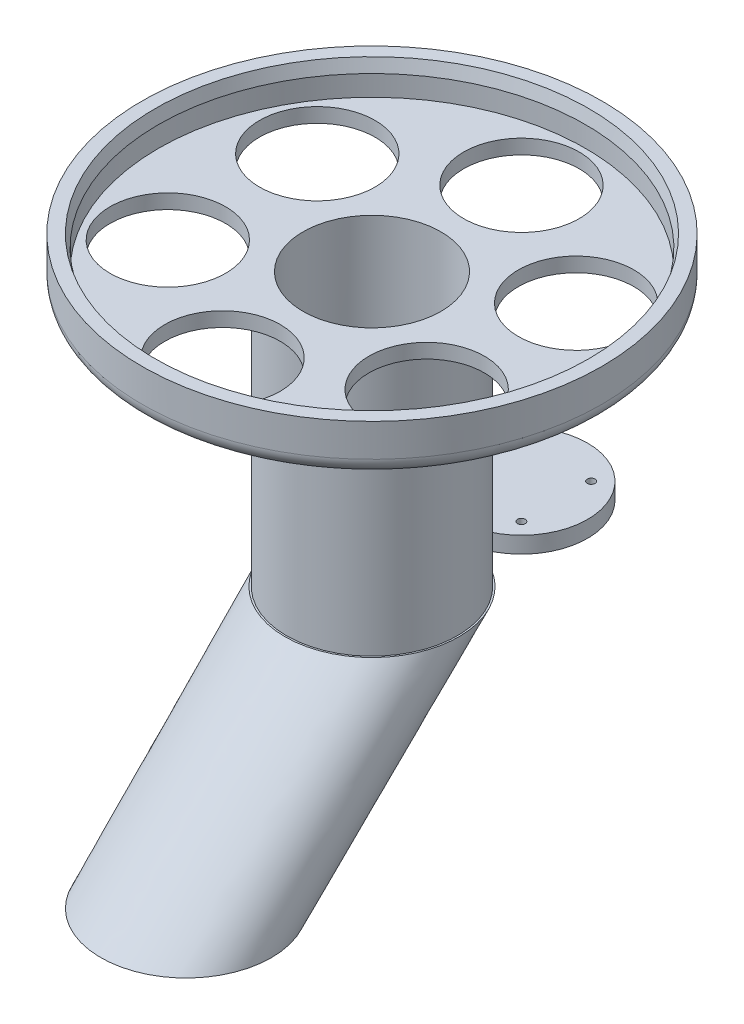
ISO-10303-21;
HEADER;
FILE_DESCRIPTION(('STEP AP214'),'2;1');
FILE_NAME('part.step','',(''),(''),'','','');
FILE_SCHEMA(('AUTOMOTIVE_DESIGN { 1 0 10303 214 1 1 1 1 }'));
ENDSEC;
DATA;
#1=APPLICATION_CONTEXT('core data for automotive mechanical design processes');
#2=APPLICATION_PROTOCOL_DEFINITION('international standard','automotive_design',2000,#1);
#3=PRODUCT_CONTEXT('',#1,'mechanical');
#4=PRODUCT('Part','Part','',(#3));
#5=PRODUCT_RELATED_PRODUCT_CATEGORY('part','',(#4));
#6=PRODUCT_DEFINITION_FORMATION('','',#4);
#7=PRODUCT_DEFINITION_CONTEXT('part definition',#1,'design');
#8=PRODUCT_DEFINITION('design','',#6,#7);
#9=PRODUCT_DEFINITION_SHAPE('','',#8);
#10=(LENGTH_UNIT() NAMED_UNIT(*) SI_UNIT(.MILLI.,.METRE.));
#11=(NAMED_UNIT(*) PLANE_ANGLE_UNIT() SI_UNIT($,.RADIAN.));
#12=(NAMED_UNIT(*) SI_UNIT($,.STERADIAN.) SOLID_ANGLE_UNIT());
#13=UNCERTAINTY_MEASURE_WITH_UNIT(LENGTH_MEASURE(1.E-05),#10,'distance_accuracy_value','');
#14=(GEOMETRIC_REPRESENTATION_CONTEXT(3) GLOBAL_UNCERTAINTY_ASSIGNED_CONTEXT((#13)) GLOBAL_UNIT_ASSIGNED_CONTEXT((#10,
#11,#12)) REPRESENTATION_CONTEXT('',''));
#15=CARTESIAN_POINT('',(0.,0.,0.));
#16=DIRECTION('',(0.,0.,1.));
#17=DIRECTION('',(1.,0.,0.));
#18=AXIS2_PLACEMENT_3D('',#15,#16,#17);
#19=CARTESIAN_POINT('',(3.18893482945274E-13,-93.02,0.));
#20=DIRECTION('',(0.,-1.,0.));
#21=DIRECTION('',(1.,0.,0.));
#22=AXIS2_PLACEMENT_3D('',#19,#20,#21);
#23=PLANE('',#22);
#24=CARTESIAN_POINT('',(3.18893482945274E-13,-93.02,0.));
#25=DIRECTION('',(0.,1.,0.));
#26=DIRECTION('',(-1.,0.,0.));
#27=AXIS2_PLACEMENT_3D('',#24,#25,#26);
#28=CIRCLE('',#27,23.5000000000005);
#29=CARTESIAN_POINT('',(-23.5000000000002,-93.0200000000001,0.));
#30=VERTEX_POINT('',#29);
#31=EDGE_CURVE('E12',#30,#30,#28,.T.);
#32=ORIENTED_EDGE('',*,*,#31,.T.);
#33=EDGE_LOOP('',(#32));
#34=FACE_BOUND('',#33,.T.);
#35=CARTESIAN_POINT('',(-20.9997055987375,-93.02,-2.55959082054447E-08));
#36=CARTESIAN_POINT('',(-20.9996448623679,-93.02,0.590089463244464));
#37=CARTESIAN_POINT('',(-20.9748347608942,-93.02,1.18034168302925));
#38=CARTESIAN_POINT('',(-20.9004764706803,-93.0200000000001,2.06244870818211));
#39=CARTESIAN_POINT('',(-20.8694877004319,-93.0200000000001,2.35601070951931));
#40=CARTESIAN_POINT('',(-20.7950572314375,-93.0200000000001,2.94157157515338));
#41=CARTESIAN_POINT('',(-20.7516158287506,-93.0200000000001,3.23357047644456));
#42=CARTESIAN_POINT('',(-20.6523443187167,-93.0200000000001,3.81577790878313));
#43=CARTESIAN_POINT('',(-20.5965005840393,-93.0200000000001,4.10598410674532));
#44=CARTESIAN_POINT('',(-20.4726767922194,-93.0200000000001,4.68380151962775));
#45=CARTESIAN_POINT('',(-20.4046965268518,-93.0200000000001,4.97141268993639));
#46=CARTESIAN_POINT('',(-20.2567464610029,-93.0200000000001,5.54351282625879));
#47=CARTESIAN_POINT('',(-20.1767775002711,-93.0200000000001,5.82800200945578));
#48=CARTESIAN_POINT('',(-20.0049607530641,-93.0200000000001,6.39336741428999));
#49=CARTESIAN_POINT('',(-19.9131131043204,-93.0200000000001,6.67424367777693));
#50=CARTESIAN_POINT('',(-19.7175853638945,-93.0200000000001,7.23198296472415));
#51=CARTESIAN_POINT('',(-19.6139002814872,-93.0200000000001,7.5088442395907));
#52=CARTESIAN_POINT('',(-19.3947792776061,-93.0200000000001,8.05787711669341));
#53=CARTESIAN_POINT('',(-19.2793433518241,-93.0200000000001,8.33004871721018));
#54=CARTESIAN_POINT('',(-19.0370676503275,-93.0200000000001,8.8692703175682));
#55=CARTESIAN_POINT('',(-18.9102277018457,-93.0200000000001,9.1363202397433));
#56=CARTESIAN_POINT('',(-18.6454545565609,-93.0200000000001,9.66486578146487));
#57=CARTESIAN_POINT('',(-18.5075212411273,-93.0200000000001,9.92636134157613));
#58=CARTESIAN_POINT('',(-18.2208617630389,-93.0200000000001,10.44327899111));
#59=CARTESIAN_POINT('',(-18.072138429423,-93.02,10.6987026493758));
#60=CARTESIAN_POINT('',(-17.7640974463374,-93.02,11.2030765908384));
#61=CARTESIAN_POINT('',(-17.6047799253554,-93.02,11.4520269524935));
#62=CARTESIAN_POINT('',(-17.2757348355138,-93.02,11.9429517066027));
#63=CARTESIAN_POINT('',(-17.1060073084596,-93.02,12.1849261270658));
#64=CARTESIAN_POINT('',(-16.756353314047,-93.02,12.6613905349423));
#65=CARTESIAN_POINT('',(-16.576426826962,-93.0200000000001,12.8958805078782));
#66=CARTESIAN_POINT('',(-16.2074053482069,-93.0200000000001,13.3563492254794));
#67=CARTESIAN_POINT('',(-16.0183401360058,-93.02,13.5823518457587));
#68=CARTESIAN_POINT('',(-15.6309236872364,-93.02,14.0262555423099));
#69=CARTESIAN_POINT('',(-15.4325723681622,-93.02,14.2441565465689));
#70=CARTESIAN_POINT('',(-15.0269465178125,-93.02,14.6714892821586));
#71=CARTESIAN_POINT('',(-14.8196719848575,-93.02,14.8809210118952));
#72=CARTESIAN_POINT('',(-14.3965396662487,-93.02,15.2909201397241));
#73=CARTESIAN_POINT('',(-14.1806819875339,-93.02,15.4914876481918));
#74=CARTESIAN_POINT('',(-13.7406452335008,-93.02,15.8833220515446));
#75=CARTESIAN_POINT('',(-13.5164655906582,-93.02,16.0745883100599));
#76=CARTESIAN_POINT('',(-13.0601915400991,-93.02,16.4473907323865));
#77=CARTESIAN_POINT('',(-12.8280970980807,-93.02,16.6289268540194));
#78=CARTESIAN_POINT('',(-12.1206525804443,-93.02,17.1586711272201));
#79=CARTESIAN_POINT('',(-11.6340459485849,-93.02,17.4920999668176));
#80=CARTESIAN_POINT('',(-10.8839037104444,-93.02,17.9613158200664));
#81=CARTESIAN_POINT('',(-10.630009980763,-93.02,18.1128106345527));
#82=CARTESIAN_POINT('',(-10.1160527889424,-93.02,18.4049970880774));
#83=CARTESIAN_POINT('',(-9.85598940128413,-93.02,18.5456888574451));
#84=CARTESIAN_POINT('',(-9.33010369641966,-93.02,18.8158641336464));
#85=CARTESIAN_POINT('',(-9.06428138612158,-93.02,18.9453476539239));
#86=CARTESIAN_POINT('',(-8.52740508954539,-93.02,19.1929099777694));
#87=CARTESIAN_POINT('',(-8.25635105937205,-93.02,19.3109886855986));
#88=CARTESIAN_POINT('',(-7.43607903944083,-93.02,19.6479323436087));
#89=CARTESIAN_POINT('',(-6.87961994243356,-93.02,19.8495721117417));
#90=CARTESIAN_POINT('',(-6.03393642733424,-93.02,20.1164039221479));
#91=CARTESIAN_POINT('',(-5.75017635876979,-93.02,20.1994173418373));
#92=CARTESIAN_POINT('',(-5.17939065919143,-93.02,20.3533641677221));
#93=CARTESIAN_POINT('',(-4.89236505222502,-93.02,20.4242976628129));
#94=CARTESIAN_POINT('',(-4.02818240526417,-93.02,20.6184931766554));
#95=CARTESIAN_POINT('',(-3.44681780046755,-93.02,20.7234979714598));
#96=CARTESIAN_POINT('',(-2.27740495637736,-93.02,20.8843374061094));
#97=CARTESIAN_POINT('',(-1.68935672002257,-93.02,20.9401720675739));
#98=CARTESIAN_POINT('',(-0.510617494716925,-93.02,21.0020721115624));
#99=CARTESIAN_POINT('',(0.0800735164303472,-93.02,21.0081370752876));
#100=CARTESIAN_POINT('',(1.25986328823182,-93.02,20.9704780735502));
#101=CARTESIAN_POINT('',(1.84896205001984,-93.02,20.9267541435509));
#102=CARTESIAN_POINT('',(3.02162134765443,-93.02,20.7898517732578));
#103=CARTESIAN_POINT('',(3.60517938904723,-93.02,20.6966520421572));
#104=CARTESIAN_POINT('',(4.76245132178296,-93.02,20.4614058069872));
#105=CARTESIAN_POINT('',(5.33616520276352,-93.02,20.3193592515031));
#106=CARTESIAN_POINT('',(6.18605213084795,-93.02,20.0704117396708));
#107=CARTESIAN_POINT('',(6.467594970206,-93.02,19.9814388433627));
#108=CARTESIAN_POINT('',(7.02671663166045,-93.02,19.7917243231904));
#109=CARTESIAN_POINT('',(7.30429534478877,-93.02,19.6909823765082));
#110=CARTESIAN_POINT('',(7.85497160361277,-93.02,19.4778986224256));
#111=CARTESIAN_POINT('',(8.12806897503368,-93.02,19.3655563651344));
#112=CARTESIAN_POINT('',(8.66924171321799,-93.02,19.1294290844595));
#113=CARTESIAN_POINT('',(8.93731756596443,-93.02,19.0056451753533));
#114=CARTESIAN_POINT('',(9.46795944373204,-93.02,18.7468930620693));
#115=CARTESIAN_POINT('',(9.73052637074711,-93.02,18.6119267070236));
#116=CARTESIAN_POINT('',(10.2497052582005,-93.02,18.3311432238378));
#117=CARTESIAN_POINT('',(10.5063187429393,-93.0199999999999,18.1853289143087));
#118=CARTESIAN_POINT('',(11.0131799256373,-93.0199999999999,17.8829697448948));
#119=CARTESIAN_POINT('',(11.2634270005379,-93.0199999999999,17.7264238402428));
#120=CARTESIAN_POINT('',(11.7570900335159,-93.0199999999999,17.4028740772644));
#121=CARTESIAN_POINT('',(12.0005055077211,-93.0199999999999,17.2358694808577));
#122=CARTESIAN_POINT('',(12.4801235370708,-93.0199999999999,16.891817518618));
#123=CARTESIAN_POINT('',(12.7163262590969,-93.0199999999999,16.7147703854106));
#124=CARTESIAN_POINT('',(13.1810400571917,-93.0199999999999,16.350861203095));
#125=CARTESIAN_POINT('',(13.409551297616,-93.0199999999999,16.1639993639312));
#126=CARTESIAN_POINT('',(13.8584598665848,-93.0199999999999,15.7807709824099));
#127=CARTESIAN_POINT('',(14.0788571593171,-93.0199999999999,15.5844043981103));
#128=CARTESIAN_POINT('',(14.5112232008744,-93.0199999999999,15.1825991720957));
#129=CARTESIAN_POINT('',(14.7231918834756,-93.02,14.9771604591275));
#130=CARTESIAN_POINT('',(15.1384418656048,-93.02,14.5573764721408));
#131=CARTESIAN_POINT('',(15.3417165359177,-93.0199999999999,14.3430246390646));
#132=CARTESIAN_POINT('',(15.7390091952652,-93.0199999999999,13.905909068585));
#133=CARTESIAN_POINT('',(15.9330272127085,-93.0199999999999,13.6831453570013));
#134=CARTESIAN_POINT('',(16.3114954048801,-93.0199999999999,13.2296339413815));
#135=CARTESIAN_POINT('',(16.495945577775,-93.0199999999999,12.9988862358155));
#136=CARTESIAN_POINT('',(16.8549812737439,-93.0199999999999,12.5298408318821));
#137=CARTESIAN_POINT('',(17.0295667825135,-93.0199999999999,12.2915431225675));
#138=CARTESIAN_POINT('',(17.3685243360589,-93.0199999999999,11.8077819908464));
#139=CARTESIAN_POINT('',(17.5328963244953,-93.0199999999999,11.5623185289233));
#140=CARTESIAN_POINT('',(17.8511125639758,-93.0199999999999,11.0646843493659));
#141=CARTESIAN_POINT('',(18.0049568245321,-93.0199999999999,10.812513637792));
#142=CARTESIAN_POINT('',(18.4503172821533,-93.0199999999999,10.046618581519));
#143=CARTESIAN_POINT('',(18.7257371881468,-93.02,9.52340274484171));
#144=CARTESIAN_POINT('',(19.2312784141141,-93.02,8.45611342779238));
#145=CARTESIAN_POINT('',(19.4614347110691,-93.0199999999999,7.91205644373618));
#146=CARTESIAN_POINT('',(19.8751194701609,-93.0199999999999,6.80646312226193));
#147=CARTESIAN_POINT('',(20.0586479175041,-93.0199999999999,6.24492677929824));
#148=CARTESIAN_POINT('',(20.3776756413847,-93.0199999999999,5.1084121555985));
#149=CARTESIAN_POINT('',(20.5131755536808,-93.0199999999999,4.53343405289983));
#150=CARTESIAN_POINT('',(20.7354512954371,-93.0199999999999,3.37405582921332));
#151=CARTESIAN_POINT('',(20.8222271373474,-93.0199999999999,2.78965571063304));
#152=CARTESIAN_POINT('',(20.9151248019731,-93.0199999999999,1.90912973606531));
#153=CARTESIAN_POINT('',(20.9398817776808,-93.0199999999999,1.61486457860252));
#154=CARTESIAN_POINT('',(20.9769093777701,-93.0199999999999,1.0255491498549));
#155=CARTESIAN_POINT('',(20.9891799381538,-93.0199999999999,0.730498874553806));
#156=CARTESIAN_POINT('',(21.0073865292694,-93.0199999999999,-0.155003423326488));
#157=CARTESIAN_POINT('',(20.9947316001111,-93.0199999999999,-0.74594174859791));
#158=CARTESIAN_POINT('',(20.9198265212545,-93.0199999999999,-1.92462369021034));
#159=CARTESIAN_POINT('',(20.8575755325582,-93.0199999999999,-2.51236725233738));
#160=CARTESIAN_POINT('',(20.6833237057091,-93.0199999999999,-3.68043108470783));
#161=CARTESIAN_POINT('',(20.5713224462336,-93.0199999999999,-4.26075129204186));
#162=CARTESIAN_POINT('',(20.299288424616,-93.0199999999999,-5.40959218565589));
#163=CARTESIAN_POINT('',(20.1392942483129,-93.0199999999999,-5.97812196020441));
#164=CARTESIAN_POINT('',(19.8639811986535,-93.0199999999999,-6.81919983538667));
#165=CARTESIAN_POINT('',(19.7663106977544,-93.0199999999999,-7.09763591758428));
#166=CARTESIAN_POINT('',(19.5592166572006,-93.0199999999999,-7.65012050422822));
#167=CARTESIAN_POINT('',(19.4497932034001,-93.0199999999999,-7.92416904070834));
#168=CARTESIAN_POINT('',(19.2193886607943,-93.0199999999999,-8.46736014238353));
#169=CARTESIAN_POINT('',(19.0984077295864,-93.0199999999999,-8.73650277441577));
#170=CARTESIAN_POINT('',(18.8452674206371,-93.0199999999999,-9.26945127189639));
#171=CARTESIAN_POINT('',(18.7131078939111,-93.0199999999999,-9.53325706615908));
#172=CARTESIAN_POINT('',(18.3002428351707,-93.0199999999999,-10.3160605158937));
#173=CARTESIAN_POINT('',(18.0030993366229,-93.02,-10.8265654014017));
#174=CARTESIAN_POINT('',(17.5258094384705,-93.02,-11.5726069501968));
#175=CARTESIAN_POINT('',(17.3612334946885,-93.0199999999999,-11.8182848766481));
#176=CARTESIAN_POINT('',(17.0217167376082,-93.0199999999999,-12.302405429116));
#177=CARTESIAN_POINT('',(16.846775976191,-93.0199999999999,-12.5408480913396));
#178=CARTESIAN_POINT('',(16.486913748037,-93.0199999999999,-13.0100669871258));
#179=CARTESIAN_POINT('',(16.3019922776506,-93.0199999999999,-13.2408432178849));
#180=CARTESIAN_POINT('',(15.9226041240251,-93.0199999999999,-13.6944174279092));
#181=CARTESIAN_POINT('',(15.728137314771,-93.0199999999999,-13.9172153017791));
#182=CARTESIAN_POINT('',(15.3300422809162,-93.0199999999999,-14.3544627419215));
#183=CARTESIAN_POINT('',(15.1264142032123,-93.0199999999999,-14.5689124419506));
#184=CARTESIAN_POINT('',(14.7103448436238,-93.0199999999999,-14.9890815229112));
#185=CARTESIAN_POINT('',(14.4979036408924,-93.0199999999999,-15.194800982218));
#186=CARTESIAN_POINT('',(14.0645310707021,-93.0199999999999,-15.5970962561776));
#187=CARTESIAN_POINT('',(13.8435997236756,-93.0199999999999,-15.7936720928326));
#188=CARTESIAN_POINT('',(13.3935306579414,-93.02,-16.1771929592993));
#189=CARTESIAN_POINT('',(13.1643929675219,-93.02,-16.3641380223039));
#190=CARTESIAN_POINT('',(12.6992128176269,-93.02,-16.7275059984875));
#191=CARTESIAN_POINT('',(12.4631972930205,-93.02,-16.9039634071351));
#192=CARTESIAN_POINT('',(11.9839746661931,-93.0199999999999,-17.2468307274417));
#193=CARTESIAN_POINT('',(11.7407674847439,-93.0199999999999,-17.413240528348));
#194=CARTESIAN_POINT('',(11.2476091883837,-93.0199999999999,-17.735750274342));
#195=CARTESIAN_POINT('',(10.9976580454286,-93.0199999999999,-17.8918501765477));
#196=CARTESIAN_POINT('',(10.4914466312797,-93.0199999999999,-18.1934533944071));
#197=CARTESIAN_POINT('',(10.2351864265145,-93.02,-18.338956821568));
#198=CARTESIAN_POINT('',(9.71674442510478,-93.02,-18.6190332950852));
#199=CARTESIAN_POINT('',(9.45456247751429,-93.02,-18.7536060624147));
#200=CARTESIAN_POINT('',(8.92473244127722,-93.02,-19.0114768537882));
#201=CARTESIAN_POINT('',(8.65708434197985,-93.02,-19.1347748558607));
#202=CARTESIAN_POINT('',(7.84673225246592,-93.02,-19.4875911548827));
#203=CARTESIAN_POINT('',(7.29650417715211,-93.02,-19.7000944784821));
#204=CARTESIAN_POINT('',(6.17867526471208,-93.02,-20.0788950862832));
#205=CARTESIAN_POINT('',(5.6110291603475,-93.02,-20.2450582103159));
#206=CARTESIAN_POINT('',(4.46368823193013,-93.02,-20.5286631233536));
#207=CARTESIAN_POINT('',(3.88399341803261,-93.02,-20.6461049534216));
#208=CARTESIAN_POINT('',(2.71671952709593,-93.02,-20.8317692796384));
#209=CARTESIAN_POINT('',(2.12914052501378,-93.02,-20.8999922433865));
#210=CARTESIAN_POINT('',(1.24517411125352,-93.02,-20.9650689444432));
#211=CARTESIAN_POINT('',(0.950052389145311,-93.02,-20.9805511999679));
#212=CARTESIAN_POINT('',(0.359418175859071,-93.02,-20.9990099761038));
#213=CARTESIAN_POINT('',(0.0639056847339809,-93.02,-21.0019864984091));
#214=CARTESIAN_POINT('',(-0.821754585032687,-93.02,-20.992204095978));
#215=CARTESIAN_POINT('',(-1.41180321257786,-93.02,-20.9607902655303));
#216=CARTESIAN_POINT('',(-2.58708426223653,-93.02,-20.8483778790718));
#217=CARTESIAN_POINT('',(-3.17231669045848,-93.02,-20.7673793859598));
#218=CARTESIAN_POINT('',(-4.33389884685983,-93.02,-20.5564269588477));
#219=CARTESIAN_POINT('',(-4.91024848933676,-93.02,-20.426472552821));
#220=CARTESIAN_POINT('',(-6.04998840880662,-93.02,-20.1183475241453));
#221=CARTESIAN_POINT('',(-6.61337868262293,-93.02,-19.9401768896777));
#222=CARTESIAN_POINT('',(-7.44569127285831,-93.02,-19.6379589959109));
#223=CARTESIAN_POINT('',(-7.72107088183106,-93.02,-19.5313600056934));
#224=CARTESIAN_POINT('',(-8.26708298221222,-93.02,-19.3066269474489));
#225=CARTESIAN_POINT('',(-8.53771580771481,-93.02,-19.1884936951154));
#226=CARTESIAN_POINT('',(-9.07371042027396,-93.02,-18.940897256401));
#227=CARTESIAN_POINT('',(-9.33907270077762,-93.02,-18.8114351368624));
#228=CARTESIAN_POINT('',(-9.864190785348,-93.02,-18.5414395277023));
#229=CARTESIAN_POINT('',(-10.1239451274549,-93.02,-18.4009031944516));
#230=CARTESIAN_POINT('',(-10.637254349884,-93.02,-18.1090580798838));
#231=CARTESIAN_POINT('',(-10.8908106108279,-93.02,-17.9577517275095));
#232=CARTESIAN_POINT('',(-11.3913040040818,-93.02,-17.6445154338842));
#233=CARTESIAN_POINT('',(-11.6382405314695,-93.02,-17.4825845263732));
#234=CARTESIAN_POINT('',(-12.12507572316,-93.02,-17.1484741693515));
#235=CARTESIAN_POINT('',(-12.3649746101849,-93.02,-16.9762950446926));
#236=CARTESIAN_POINT('',(-12.837310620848,-93.02,-16.6220347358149));
#237=CARTESIAN_POINT('',(-13.0697477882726,-93.02,-16.4399536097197));
#238=CARTESIAN_POINT('',(-13.7550832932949,-93.02,-15.8792320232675));
#239=CARTESIAN_POINT('',(-14.1962175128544,-93.02,-15.4859680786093));
#240=CARTESIAN_POINT('',(-14.8318215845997,-93.02,-14.8695939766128));
#241=CARTESIAN_POINT('',(-15.0393462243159,-93.02,-14.6597158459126));
#242=CARTESIAN_POINT('',(-15.445426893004,-93.02,-14.2312873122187));
#243=CARTESIAN_POINT('',(-15.6439799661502,-93.02,-14.0127340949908));
#244=CARTESIAN_POINT('',(-16.0316738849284,-93.02,-13.5674198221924));
#245=CARTESIAN_POINT('',(-16.2208143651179,-93.02,-13.3406584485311));
#246=CARTESIAN_POINT('',(-16.5894084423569,-93.02,-12.8793864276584));
#247=CARTESIAN_POINT('',(-16.7688609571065,-93.02,-12.6448749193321));
#248=CARTESIAN_POINT('',(-17.2921250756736,-93.02,-11.9303096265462));
#249=CARTESIAN_POINT('',(-17.6209583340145,-93.02,-11.4390928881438));
#250=CARTESIAN_POINT('',(-18.0821796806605,-93.02,-10.6828686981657));
#251=CARTESIAN_POINT('',(-18.2306243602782,-93.0200000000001,-10.4274760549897));
#252=CARTESIAN_POINT('',(-18.5165997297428,-93.0200000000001,-9.91072768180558));
#253=CARTESIAN_POINT('',(-18.6541331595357,-93.0200000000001,-9.64937347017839));
#254=CARTESIAN_POINT('',(-19.0500404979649,-93.0200000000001,-8.85687442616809));
#255=CARTESIAN_POINT('',(-19.291732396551,-93.0200000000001,-8.31727524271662));
#256=CARTESIAN_POINT('',(-19.7285357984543,-93.0200000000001,-7.22033150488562));
#257=CARTESIAN_POINT('',(-19.9236987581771,-93.02,-6.66300733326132));
#258=CARTESIAN_POINT('',(-20.2662751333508,-93.0200000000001,-5.53394435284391));
#259=CARTESIAN_POINT('',(-20.4137006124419,-93.0200000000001,-4.96220922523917));
#260=CARTESIAN_POINT('',(-20.6137468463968,-93.0200000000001,-4.02530105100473));
#261=CARTESIAN_POINT('',(-20.6811770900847,-93.0200000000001,-3.6632158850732));
#262=CARTESIAN_POINT('',(-20.7969327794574,-93.02,-2.93606643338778));
#263=CARTESIAN_POINT('',(-20.8452626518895,-93.0200000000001,-2.57100285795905));
#264=CARTESIAN_POINT('',(-20.9225745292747,-93.0200000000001,-1.83882685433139));
#265=CARTESIAN_POINT('',(-20.9515564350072,-93.0200000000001,-1.47171441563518));
#266=CARTESIAN_POINT('',(-20.9901431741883,-93.02,-0.736422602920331));
#267=CARTESIAN_POINT('',(-20.999743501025,-93.02,-0.368243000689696));
#268=CARTESIAN_POINT('',(-20.9997055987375,-93.02,-2.55959082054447E-08));
#269=B_SPLINE_CURVE_WITH_KNOTS('',3,(#35,#36,#37,#38,#39,#40,#41,#42,#43,#44,#45,#46,#47,#48,
#49,#50,#51,#52,#53,#54,#55,#56,#57,#58,#59,#60,#61,#62,#63,#64,#65,#66,#67,#68,#69,#70,#71,#72,
#73,#74,#75,#76,#77,#78,#79,#80,#81,#82,#83,#84,#85,#86,#87,#88,#89,#90,#91,#92,#93,#94,#95,#96,
#97,#98,#99,#100,#101,#102,#103,#104,#105,#106,#107,#108,#109,#110,#111,#112,#113,#114,#115,
#116,#117,#118,#119,#120,#121,#122,#123,#124,#125,#126,#127,#128,#129,#130,#131,#132,#133,#134,
#135,#136,#137,#138,#139,#140,#141,#142,#143,#144,#145,#146,#147,#148,#149,#150,#151,#152,#153,
#154,#155,#156,#157,#158,#159,#160,#161,#162,#163,#164,#165,#166,#167,#168,#169,#170,#171,#172,
#173,#174,#175,#176,#177,#178,#179,#180,#181,#182,#183,#184,#185,#186,#187,#188,#189,#190,#191,
#192,#193,#194,#195,#196,#197,#198,#199,#200,#201,#202,#203,#204,#205,#206,#207,#208,#209,#210,
#211,#212,#213,#214,#215,#216,#217,#218,#219,#220,#221,#222,#223,#224,#225,#226,#227,#228,#229,
#230,#231,#232,#233,#234,#235,#236,#237,#238,#239,#240,#241,#242,#243,#244,#245,#246,#247,#248,
#249,#250,#251,#252,#253,#254,#255,#256,#257,#258,#259,#260,#261,#262,#263,#264,#265,#266,#267,
#268),.UNSPECIFIED.,.T.,.F.,(4,2,2,2,2,2,2,2,2,2,2,2,2,2,2,2,2,2,2,2,2,2,2,2,2,2,2,2,2,2,2,2,2,
2,2,2,2,2,2,2,2,2,2,2,2,2,2,2,2,2,2,2,2,2,2,2,2,2,2,2,2,2,2,2,2,2,2,2,2,2,2,2,2,2,2,2,2,2,2,2,2,
2,2,2,2,2,2,2,2,2,2,2,2,2,2,2,2,2,2,2,2,2,2,2,2,2,2,2,2,2,2,2,2,2,2,2,4),(0.,1.76988284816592,
2.65525834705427,3.54061279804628,4.42694490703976,5.31329222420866,6.19957748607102,
7.08585247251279,7.97250250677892,8.85915286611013,9.74581666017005,10.6324899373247,
11.5189315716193,12.4053624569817,13.2917897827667,14.1782188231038,15.0619320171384,
15.9456530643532,16.8293742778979,17.7130844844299,18.5968550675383,19.4806294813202,
21.2477966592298,22.1345711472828,23.0213349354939,23.9080976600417,24.7948678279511,
26.5679672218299,27.4547197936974,28.3414658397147,30.1115033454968,31.8815400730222,
33.6515916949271,35.4216420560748,37.1924547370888,38.9632692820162,39.8488551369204,
40.7344652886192,41.6201097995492,42.5056681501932,43.3910803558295,44.276263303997,
45.1615325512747,46.0468643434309,46.9321756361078,47.8174679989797,48.7027642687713,
49.5880674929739,50.4740341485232,51.359998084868,52.2459621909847,53.1319275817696,
54.0178978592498,54.9038673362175,56.6754099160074,58.4455781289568,60.2157469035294,
61.985892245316,63.7560371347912,64.6417209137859,65.5274092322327,67.2983804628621,
69.0693816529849,70.8403978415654,72.6099939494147,73.4949841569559,74.3799679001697,
75.2649395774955,76.1499230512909,77.9194962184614,78.8064173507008,79.6933340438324,
80.5802510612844,81.4671797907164,82.3540943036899,83.241000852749,84.1279052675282,
85.0148066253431,85.8986078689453,86.7824188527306,87.6662335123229,88.5500388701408,
89.4338667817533,90.3176964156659,92.0849605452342,93.8572892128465,95.6296163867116,
97.4019267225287,98.288280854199,99.1746348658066,100.945009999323,102.715382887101,
104.485772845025,106.256163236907,107.141825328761,108.027424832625,108.912941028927,
109.798685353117,110.684230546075,111.569856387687,112.455454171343,113.341046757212,
115.111463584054,115.99672806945,116.882282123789,117.767870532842,118.653557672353,
120.424407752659,121.310399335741,122.196167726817,123.967641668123,125.737147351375,
127.506205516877,128.610687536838,129.714913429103,130.819144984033,131.923633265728),.UNSPECIFIED.);
#270=CARTESIAN_POINT('',(-12.3114442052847,-93.02,-17.0125936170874));
#271=VERTEX_POINT('',#270);
#272=EDGE_CURVE('E77',#271,#271,#269,.F.);
#273=ORIENTED_EDGE('',*,*,#272,.T.);
#274=EDGE_LOOP('',(#273));
#275=FACE_BOUND('',#274,.T.);
#276=ADVANCED_FACE('F72',(#34,#275),#23,.F.);
#277=CARTESIAN_POINT('',(-21.,-93.0200000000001,0.));
#278=DIRECTION('',(0.,1.,0.));
#279=DIRECTION('',(-1.,0.,0.));
#280=AXIS2_PLACEMENT_3D('',#277,#278,#279);
#281=PLANE('',#280);
#282=CARTESIAN_POINT('',(10.6066017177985,-93.0199999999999,-56.1066017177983));
#283=DIRECTION('',(0.,-1.,0.));
#284=DIRECTION('',(0.,0.,-1.));
#285=AXIS2_PLACEMENT_3D('',#282,#283,#284);
#286=CIRCLE('',#285,1.175);
#287=CARTESIAN_POINT('',(10.6066017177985,-93.0199999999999,-57.2816017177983));
#288=VERTEX_POINT('',#287);
#289=EDGE_CURVE('E411',#288,#288,#286,.T.);
#290=ORIENTED_EDGE('',*,*,#289,.F.);
#291=EDGE_LOOP('',(#290));
#292=FACE_BOUND('',#291,.T.);
#293=CARTESIAN_POINT('',(-10.6066017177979,-93.02,-34.8933982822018));
#294=DIRECTION('',(0.,-1.,0.));
#295=DIRECTION('',(0.,0.,-1.));
#296=AXIS2_PLACEMENT_3D('',#293,#294,#295);
#297=CIRCLE('',#296,1.175);
#298=CARTESIAN_POINT('',(-10.6066017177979,-93.02,-36.0683982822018));
#299=VERTEX_POINT('',#298);
#300=EDGE_CURVE('E426',#299,#299,#297,.T.);
#301=ORIENTED_EDGE('',*,*,#300,.F.);
#302=EDGE_LOOP('',(#301));
#303=FACE_BOUND('',#302,.T.);
#304=CARTESIAN_POINT('',(3.01290859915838E-13,-93.02,-45.5000000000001));
#305=DIRECTION('',(0.,-1.,0.));
#306=DIRECTION('',(1.,0.,0.));
#307=AXIS2_PLACEMENT_3D('',#304,#305,#306);
#308=CIRCLE('',#307,20.14);
#309=CARTESIAN_POINT('',(-5.07412829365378,-93.02,-26.0096736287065));
#310=VERTEX_POINT('',#309);
#311=CARTESIAN_POINT('',(5.07412272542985,-93.02,-26.0095661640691));
#312=VERTEX_POINT('',#311);
#313=EDGE_CURVE('E150',#310,#312,#308,.T.);
#314=ORIENTED_EDGE('',*,*,#313,.T.);
#315=CARTESIAN_POINT('',(3.18893482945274E-13,-93.02,0.));
#316=DIRECTION('',(0.,-1.,0.));
#317=DIRECTION('',(1.,0.,0.));
#318=AXIS2_PLACEMENT_3D('',#315,#316,#317);
#319=CIRCLE('',#318,26.5000000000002);
#320=EDGE_CURVE('E134',#310,#312,#319,.T.);
#321=ORIENTED_EDGE('',*,*,#320,.F.);
#322=EDGE_LOOP('',(#314,#321));
#323=FACE_BOUND('',#322,.T.);
#324=CARTESIAN_POINT('',(10.6066017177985,-93.0199999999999,-34.8933982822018));
#325=DIRECTION('',(0.,-1.,0.));
#326=DIRECTION('',(0.,0.,-1.));
#327=AXIS2_PLACEMENT_3D('',#324,#325,#326);
#328=CIRCLE('',#327,1.175);
#329=CARTESIAN_POINT('',(10.6066017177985,-93.0199999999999,-36.0683982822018));
#330=VERTEX_POINT('',#329);
#331=EDGE_CURVE('E434',#330,#330,#328,.T.);
#332=ORIENTED_EDGE('',*,*,#331,.F.);
#333=EDGE_LOOP('',(#332));
#334=FACE_BOUND('',#333,.T.);
#335=CARTESIAN_POINT('',(-10.6066017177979,-93.02,-56.1066017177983));
#336=DIRECTION('',(0.,-1.,0.));
#337=DIRECTION('',(0.,0.,-1.));
#338=AXIS2_PLACEMENT_3D('',#335,#336,#337);
#339=CIRCLE('',#338,1.175);
#340=CARTESIAN_POINT('',(-10.6066017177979,-93.02,-57.2816017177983));
#341=VERTEX_POINT('',#340);
#342=EDGE_CURVE('E418',#341,#341,#339,.T.);
#343=ORIENTED_EDGE('',*,*,#342,.F.);
#344=EDGE_LOOP('',(#343));
#345=FACE_BOUND('',#344,.T.);
#346=ADVANCED_FACE('F158',(#292,#303,#323,#334,#345),#281,.F.);
#347=CARTESIAN_POINT('',(0.,0.,0.));
#348=DIRECTION('',(0.,-1.,0.));
#349=DIRECTION('',(1.,0.,0.));
#350=AXIS2_PLACEMENT_3D('',#347,#348,#349);
#351=CYLINDRICAL_SURFACE('',#350,26.0000000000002);
#352=DIRECTION('',(0.,-1.,0.));
#353=VECTOR('',#352,1.);
#354=CARTESIAN_POINT('',(3.79726114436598,-51.5099999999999,-25.7212131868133));
#355=LINE('',#354,#353);
#356=CARTESIAN_POINT('',(3.79726114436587,-15.4999999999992,-25.7212131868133));
#357=VERTEX_POINT('',#356);
#358=CARTESIAN_POINT('',(3.79726114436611,-88.0199999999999,-25.7212131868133));
#359=VERTEX_POINT('',#358);
#360=EDGE_CURVE('E156',#357,#359,#355,.T.);
#361=ORIENTED_EDGE('',*,*,#360,.F.);
#362=CARTESIAN_POINT('',(0.,-15.4999999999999,0.));
#363=DIRECTION('',(0.,1.,0.));
#364=DIRECTION('',(-1.,0.,0.));
#365=AXIS2_PLACEMENT_3D('',#362,#363,#364);
#366=CIRCLE('',#365,26.0000000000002);
#367=CARTESIAN_POINT('',(-3.79726114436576,-15.4999999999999,-25.7212131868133));
#368=VERTEX_POINT('',#367);
#369=EDGE_CURVE('E566',#357,#368,#366,.F.);
#370=ORIENTED_EDGE('',*,*,#369,.T.);
#371=DIRECTION('',(0.,-1.,0.));
#372=VECTOR('',#371,1.);
#373=CARTESIAN_POINT('',(-3.79726114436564,-51.5099999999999,-25.7212131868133));
#374=LINE('',#373,#372);
#375=CARTESIAN_POINT('',(-3.79726114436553,-88.02,-25.7212131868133));
#376=VERTEX_POINT('',#375);
#377=EDGE_CURVE('E283',#376,#368,#374,.F.);
#378=ORIENTED_EDGE('',*,*,#377,.F.);
#379=DIRECTION('',(0.,-1.,0.));
#380=VECTOR('',#379,1.);
#381=CARTESIAN_POINT('',(-3.79726114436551,-90.52,-25.7212131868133));
#382=LINE('',#381,#380);
#383=CARTESIAN_POINT('',(-3.79726114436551,-93.02,-25.7212131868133));
#384=VERTEX_POINT('',#383);
#385=EDGE_CURVE('E171',#376,#384,#382,.T.);
#386=ORIENTED_EDGE('',*,*,#385,.T.);
#387=CARTESIAN_POINT('',(3.18893482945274E-13,-93.02,0.));
#388=DIRECTION('',(0.,1.,0.));
#389=DIRECTION('',(-1.,0.,0.));
#390=AXIS2_PLACEMENT_3D('',#387,#388,#389);
#391=CIRCLE('',#390,26.0000000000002);
#392=CARTESIAN_POINT('',(3.79726114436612,-93.02,-25.7212131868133));
#393=VERTEX_POINT('',#392);
#394=EDGE_CURVE('E460',#393,#384,#391,.F.);
#395=ORIENTED_EDGE('',*,*,#394,.F.);
#396=DIRECTION('',(0.,-1.,0.));
#397=VECTOR('',#396,1.);
#398=CARTESIAN_POINT('',(3.79726114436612,-90.52,-25.7212131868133));
#399=LINE('',#398,#397);
#400=EDGE_CURVE('E153',#393,#359,#399,.F.);
#401=ORIENTED_EDGE('',*,*,#400,.T.);
#402=EDGE_LOOP('',(#361,#370,#378,#386,#395,#401));
#403=FACE_BOUND('',#402,.T.);
#404=ADVANCED_FACE('F189',(#403),#351,.T.);
#405=CARTESIAN_POINT('',(0.,-15.4999999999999,0.));
#406=DIRECTION('',(0.,1.,0.));
#407=DIRECTION('',(-1.,0.,0.));
#408=AXIS2_PLACEMENT_3D('',#405,#406,#407);
#409=TOROIDAL_SURFACE('',#408,26.5000000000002,0.5);
#410=CARTESIAN_POINT('',(6.09253702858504,-15.5001999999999,-26.3036307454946));
#411=CARTESIAN_POINT('',(6.09258310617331,-15.4848406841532,-26.3036458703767));
#412=CARTESIAN_POINT('',(6.09123858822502,-15.4695252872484,-26.3032186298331));
#413=CARTESIAN_POINT('',(6.08608211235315,-15.439512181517,-26.3015829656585));
#414=CARTESIAN_POINT('',(6.08229527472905,-15.424809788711,-26.3003824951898));
#415=CARTESIAN_POINT('',(6.07149385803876,-15.3931058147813,-26.2969638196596));
#416=CARTESIAN_POINT('',(6.06395504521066,-15.376303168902,-26.294580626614));
#417=CARTESIAN_POINT('',(6.04636214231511,-15.3441666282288,-26.2890346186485));
#418=CARTESIAN_POINT('',(6.03629787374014,-15.3288390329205,-26.2858686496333));
#419=CARTESIAN_POINT('',(6.00873065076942,-15.2923747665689,-26.2772256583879));
#420=CARTESIAN_POINT('',(5.99004180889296,-15.2722276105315,-26.2713902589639));
#421=CARTESIAN_POINT('',(5.94998303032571,-15.2351244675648,-26.2589566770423));
#422=CARTESIAN_POINT('',(5.92860746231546,-15.2181753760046,-26.2523568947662));
#423=CARTESIAN_POINT('',(5.86627459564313,-15.1744566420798,-26.2332368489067));
#424=CARTESIAN_POINT('',(5.82336547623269,-15.1507172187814,-26.2202145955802));
#425=CARTESIAN_POINT('',(5.73476396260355,-15.1097681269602,-26.1936733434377));
#426=CARTESIAN_POINT('',(5.68906593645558,-15.0925722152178,-26.1801533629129));
#427=CARTESIAN_POINT('',(5.59652268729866,-15.06341875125,-26.15314404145));
#428=CARTESIAN_POINT('',(5.5496909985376,-15.0514166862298,-26.1396554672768));
#429=CARTESIAN_POINT('',(5.45510987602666,-15.0315134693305,-26.1127928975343));
#430=CARTESIAN_POINT('',(5.40735959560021,-15.0236163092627,-26.0994190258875));
#431=CARTESIAN_POINT('',(5.31114516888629,-15.0112959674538,-26.0728582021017));
#432=CARTESIAN_POINT('',(5.26267882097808,-15.006888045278,-26.0596723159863));
#433=CARTESIAN_POINT('',(5.16547384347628,-15.0011841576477,-26.0336183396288));
#434=CARTESIAN_POINT('',(5.11673513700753,-14.9998891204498,-26.0207503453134));
#435=CARTESIAN_POINT('',(4.99257966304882,-15.0001907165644,-25.9884699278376));
#436=CARTESIAN_POINT('',(4.91709645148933,-15.0037473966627,-25.9693119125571));
#437=CARTESIAN_POINT('',(4.76647252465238,-15.0170833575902,-25.9320066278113));
#438=CARTESIAN_POINT('',(4.69133172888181,-15.0268610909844,-25.9138591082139));
#439=CARTESIAN_POINT('',(4.54229367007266,-15.0526330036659,-25.878761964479));
#440=CARTESIAN_POINT('',(4.46839164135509,-15.0685893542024,-25.8618057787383));
#441=CARTESIAN_POINT('',(4.35883905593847,-15.0978628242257,-25.8373062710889));
#442=CARTESIAN_POINT('',(4.32256668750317,-15.1084998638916,-25.8293015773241));
#443=CARTESIAN_POINT('',(4.25061392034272,-15.1318182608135,-25.8136282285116));
#444=CARTESIAN_POINT('',(4.2149333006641,-15.1444988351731,-25.8059594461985));
#445=CARTESIAN_POINT('',(4.15339007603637,-15.1687975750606,-25.7929029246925));
#446=CARTESIAN_POINT('',(4.12733094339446,-15.1798705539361,-25.7874296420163));
#447=CARTESIAN_POINT('',(4.07585659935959,-15.2037059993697,-25.776722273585));
#448=CARTESIAN_POINT('',(4.05044301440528,-15.2164723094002,-25.7714887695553));
#449=CARTESIAN_POINT('',(3.9978381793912,-15.2456917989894,-25.7607575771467));
#450=CARTESIAN_POINT('',(3.97077960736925,-15.2624003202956,-25.7552989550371));
#451=CARTESIAN_POINT('',(3.91907817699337,-15.2993827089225,-25.7449726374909));
#452=CARTESIAN_POINT('',(3.89442504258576,-15.3196402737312,-25.7401024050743));
#453=CARTESIAN_POINT('',(3.86325778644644,-15.351829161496,-25.7339956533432));
#454=CARTESIAN_POINT('',(3.85463273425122,-15.3616080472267,-25.7323123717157));
#455=CARTESIAN_POINT('',(3.83860698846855,-15.382179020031,-25.7291942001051));
#456=CARTESIAN_POINT('',(3.83120588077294,-15.3929707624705,-25.7277592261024));
#457=CARTESIAN_POINT('',(3.8191548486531,-15.4138824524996,-25.7254282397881));
#458=CARTESIAN_POINT('',(3.81425711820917,-15.4238518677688,-25.7244833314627));
#459=CARTESIAN_POINT('',(3.80614050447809,-15.4444650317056,-25.7229195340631));
#460=CARTESIAN_POINT('',(3.80291598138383,-15.4551063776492,-25.7222995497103));
#461=CARTESIAN_POINT('',(3.79957187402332,-15.4715777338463,-25.7216569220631));
#462=CARTESIAN_POINT('',(3.79870484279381,-15.4772556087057,-25.7214903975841));
#463=CARTESIAN_POINT('',(3.79754387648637,-15.4886874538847,-25.7212674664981));
#464=CARTESIAN_POINT('',(3.79725154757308,-15.4944415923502,-25.721211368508));
#465=CARTESIAN_POINT('',(3.79726126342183,-15.5001999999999,-25.7212132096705));
#466=B_SPLINE_CURVE_WITH_KNOTS('',3,(#410,#411,#412,#413,#414,#415,#416,#417,#418,#419,#420,
#421,#422,#423,#424,#425,#426,#427,#428,#429,#430,#431,#432,#433,#434,#435,#436,#437,#438,#439,
#440,#441,#442,#443,#444,#445,#446,#447,#448,#449,#450,#451,#452,#453,#454,#455,#456,#457,#458,
#459,#460,#461,#462,#463,#464,#465),.UNSPECIFIED.,.F.,.F.,(4,2,2,2,2,2,2,2,2,2,2,2,2,2,2,2,2,2,
2,2,2,2,2,2,2,2,2,4),(0.,0.0459392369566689,0.0914133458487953,0.146816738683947,
0.202447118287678,0.28625220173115,0.370235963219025,0.52159683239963,0.67327418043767,
0.823624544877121,0.974120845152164,1.12527173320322,1.27646768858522,1.5100453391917,
1.74356491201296,1.97567680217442,2.09154803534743,2.20737498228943,2.29384789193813,
2.38052054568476,2.47718214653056,2.57341084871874,2.61278278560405,2.65214137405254,
2.68546774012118,2.71868103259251,2.73589186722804,2.75315073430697),.UNSPECIFIED.);
#467=CARTESIAN_POINT('',(5.07413250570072,-14.9999999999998,-26.0096747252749));
#468=VERTEX_POINT('',#467);
#469=EDGE_CURVE('E277',#468,#357,#466,.T.);
#470=ORIENTED_EDGE('',*,*,#469,.F.);
#471=CARTESIAN_POINT('',(0.,-14.9999999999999,0.));
#472=DIRECTION('',(0.,1.,0.));
#473=DIRECTION('',(-1.,0.,0.));
#474=AXIS2_PLACEMENT_3D('',#471,#472,#473);
#475=CIRCLE('',#474,26.5000000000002);
#476=CARTESIAN_POINT('',(-5.07413250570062,-14.9999999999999,-26.0096747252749));
#477=VERTEX_POINT('',#476);
#478=EDGE_CURVE('E569',#477,#468,#475,.T.);
#479=ORIENTED_EDGE('',*,*,#478,.F.);
#480=CARTESIAN_POINT('',(-3.79726126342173,-15.5001999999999,-25.7212132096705));
#481=CARTESIAN_POINT('',(-3.79721352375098,-15.4894041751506,-25.7212042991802));
#482=CARTESIAN_POINT('',(-3.7982746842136,-15.4786580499,-25.7214077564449));
#483=CARTESIAN_POINT('',(-3.80228062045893,-15.4576905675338,-25.7221773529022));
#484=CARTESIAN_POINT('',(-3.80519781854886,-15.4474638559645,-25.7227381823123));
#485=CARTESIAN_POINT('',(-3.81357185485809,-15.4250220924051,-25.7243510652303));
#486=CARTESIAN_POINT('',(-3.81949498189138,-15.412991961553,-25.7254935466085));
#487=CARTESIAN_POINT('',(-3.83314623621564,-15.3899887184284,-25.7281351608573));
#488=CARTESIAN_POINT('',(-3.84088540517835,-15.3790226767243,-25.7296364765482));
#489=CARTESIAN_POINT('',(-3.86395175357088,-15.3501767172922,-25.7341279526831));
#490=CARTESIAN_POINT('',(-3.88057116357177,-15.3333867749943,-25.7373816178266));
#491=CARTESIAN_POINT('',(-3.91585468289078,-15.3022954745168,-25.7443423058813));
#492=CARTESIAN_POINT('',(-3.93452299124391,-15.2879993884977,-25.7480502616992));
#493=CARTESIAN_POINT('',(-3.98171414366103,-15.2553122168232,-25.7574986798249));
#494=CARTESIAN_POINT('',(-4.01090915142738,-15.2379506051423,-25.7634062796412));
#495=CARTESIAN_POINT('',(-4.07072257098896,-15.2060187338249,-25.7756557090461));
#496=CARTESIAN_POINT('',(-4.10134382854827,-15.1914543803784,-25.781998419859));
#497=CARTESIAN_POINT('',(-4.16362966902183,-15.1644341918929,-25.7950563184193));
#498=CARTESIAN_POINT('',(-4.19529914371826,-15.1519906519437,-25.8017733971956));
#499=CARTESIAN_POINT('',(-4.25919418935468,-15.1289320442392,-25.8154899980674));
#500=CARTESIAN_POINT('',(-4.29141926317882,-15.1183154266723,-25.8224892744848));
#501=CARTESIAN_POINT('',(-4.39268637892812,-15.0875855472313,-25.8447497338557));
#502=CARTESIAN_POINT('',(-4.46245849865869,-15.0701865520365,-25.8604672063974));
#503=CARTESIAN_POINT('',(-4.60301454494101,-15.0411779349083,-25.8929329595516));
#504=CARTESIAN_POINT('',(-4.67379965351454,-15.0295757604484,-25.9096825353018));
#505=CARTESIAN_POINT('',(-4.81551945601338,-15.0119411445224,-25.9440376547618));
#506=CARTESIAN_POINT('',(-4.88645208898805,-15.0058841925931,-25.9616390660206));
#507=CARTESIAN_POINT('',(-5.02830313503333,-14.9994551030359,-25.997663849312));
#508=CARTESIAN_POINT('',(-5.09922148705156,-14.9990770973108,-26.0160863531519));
#509=CARTESIAN_POINT('',(-5.22225136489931,-15.0039389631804,-26.0487629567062));
#510=CARTESIAN_POINT('',(-5.27446087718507,-15.0077444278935,-26.0628561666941));
#511=CARTESIAN_POINT('',(-5.37845897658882,-15.0193224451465,-26.0913757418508));
#512=CARTESIAN_POINT('',(-5.43024654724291,-15.0271027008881,-26.1058027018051));
#513=CARTESIAN_POINT('',(-5.5443683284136,-15.0495989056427,-26.1380834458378));
#514=CARTESIAN_POINT('',(-5.60648247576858,-15.0654736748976,-26.1559847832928));
#515=CARTESIAN_POINT('',(-5.69729408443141,-15.0961069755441,-26.1826130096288));
#516=CARTESIAN_POINT('',(-5.72712579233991,-15.1074315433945,-26.19143793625));
#517=CARTESIAN_POINT('',(-5.78566794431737,-15.1327717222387,-26.2088991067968));
#518=CARTESIAN_POINT('',(-5.81437966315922,-15.1467841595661,-26.2175355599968));
#519=CARTESIAN_POINT('',(-5.86297854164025,-15.1740407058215,-26.2322665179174));
#520=CARTESIAN_POINT('',(-5.88324266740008,-15.186562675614,-26.2384456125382));
#521=CARTESIAN_POINT('',(-5.92248048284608,-15.2137075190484,-26.2504741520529));
#522=CARTESIAN_POINT('',(-5.9414526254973,-15.2283328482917,-26.2563232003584));
#523=CARTESIAN_POINT('',(-5.97766734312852,-15.2601577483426,-26.2675416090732));
#524=CARTESIAN_POINT('',(-5.99489002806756,-15.2773823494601,-26.2729053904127));
#525=CARTESIAN_POINT('',(-6.0263804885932,-15.3145860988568,-26.2827523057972));
#526=CARTESIAN_POINT('',(-6.04065619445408,-15.3345576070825,-26.2872378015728));
#527=CARTESIAN_POINT('',(-6.06051410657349,-15.369618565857,-26.2934949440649));
#528=CARTESIAN_POINT('',(-6.06738067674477,-15.3839068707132,-26.2956638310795));
#529=CARTESIAN_POINT('',(-6.07883728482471,-15.4134393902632,-26.2992871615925));
#530=CARTESIAN_POINT('',(-6.0834334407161,-15.4286809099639,-26.3007435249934));
#531=CARTESIAN_POINT('',(-6.08862686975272,-15.4533957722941,-26.3023900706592));
#532=CARTESIAN_POINT('',(-6.09009098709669,-15.4626744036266,-26.3028545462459));
#533=CARTESIAN_POINT('',(-6.09205312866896,-15.4813661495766,-26.3034771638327));
#534=CARTESIAN_POINT('',(-6.09254874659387,-15.4907795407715,-26.3036345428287));
#535=CARTESIAN_POINT('',(-6.09253702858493,-15.5001999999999,-26.3036307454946));
#536=B_SPLINE_CURVE_WITH_KNOTS('',3,(#480,#481,#482,#483,#484,#485,#486,#487,#488,#489,#490,
#491,#492,#493,#494,#495,#496,#497,#498,#499,#500,#501,#502,#503,#504,#505,#506,#507,#508,#509,
#510,#511,#512,#513,#514,#515,#516,#517,#518,#519,#520,#521,#522,#523,#524,#525,#526,#527,#528,
#529,#530,#531,#532,#533,#534,#535),.UNSPECIFIED.,.F.,.F.,(4,2,2,2,2,2,2,2,2,2,2,2,2,2,2,2,2,2,
2,2,2,2,2,2,2,2,2,4),(0.,0.0322504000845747,0.0640324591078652,0.104177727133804,
0.144573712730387,0.215714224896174,0.287003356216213,0.39018704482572,0.493586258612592,
0.597565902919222,0.70145689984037,0.921945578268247,1.14271680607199,1.36250742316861,
1.5820709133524,1.74457576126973,1.90739674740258,2.10648291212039,2.20571100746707,
2.30482265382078,2.3785537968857,2.45237172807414,2.52695216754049,2.60132921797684,
2.64916404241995,2.69686925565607,2.7250326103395,2.7532658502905),.UNSPECIFIED.);
#537=EDGE_CURVE('E268',#368,#477,#536,.T.);
#538=ORIENTED_EDGE('',*,*,#537,.F.);
#539=ORIENTED_EDGE('',*,*,#369,.F.);
#540=EDGE_LOOP('',(#470,#479,#538,#539));
#541=FACE_BOUND('',#540,.T.);
#542=ADVANCED_FACE('F197',(#541),#409,.F.);
#543=CARTESIAN_POINT('',(0.,1.07498440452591E-13,0.));
#544=DIRECTION('',(0.,-1.,0.));
#545=DIRECTION('',(1.,0.,0.));
#546=AXIS2_PLACEMENT_3D('',#543,#544,#545);
#547=PLANE('',#546);
#548=CARTESIAN_POINT('',(0.,1.07498440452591E-13,0.));
#549=DIRECTION('',(0.,-1.,0.));
#550=DIRECTION('',(1.,0.,0.));
#551=AXIS2_PLACEMENT_3D('',#548,#549,#550);
#552=CIRCLE('',#551,66.0000000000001);
#553=CARTESIAN_POINT('',(66.0000000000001,3.33761285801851E-13,0.));
#554=VERTEX_POINT('',#553);
#555=EDGE_CURVE('E500',#554,#554,#552,.T.);
#556=ORIENTED_EDGE('',*,*,#555,.T.);
#557=EDGE_LOOP('',(#556));
#558=FACE_BOUND('',#557,.T.);
#559=CARTESIAN_POINT('',(0.,1.07498440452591E-13,0.));
#560=DIRECTION('',(0.,-1.,0.));
#561=DIRECTION('',(1.,0.,0.));
#562=AXIS2_PLACEMENT_3D('',#559,#560,#561);
#563=CIRCLE('',#562,70.);
#564=CARTESIAN_POINT('',(70.,3.47474185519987E-13,0.));
#565=VERTEX_POINT('',#564);
#566=EDGE_CURVE('E496',#565,#565,#563,.T.);
#567=ORIENTED_EDGE('',*,*,#566,.F.);
#568=EDGE_LOOP('',(#567));
#569=FACE_BOUND('',#568,.T.);
#570=ADVANCED_FACE('F193',(#558,#569),#547,.F.);
#571=CARTESIAN_POINT('',(0.,0.,0.));
#572=DIRECTION('',(0.,-1.,0.));
#573=DIRECTION('',(1.,0.,0.));
#574=AXIS2_PLACEMENT_3D('',#571,#572,#573);
#575=CYLINDRICAL_SURFACE('',#574,70.);
#576=CARTESIAN_POINT('',(0.,-9.99999999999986,0.));
#577=DIRECTION('',(0.,1.,0.));
#578=DIRECTION('',(-1.,0.,0.));
#579=AXIS2_PLACEMENT_3D('',#576,#577,#578);
#580=CIRCLE('',#579,70.);
#581=CARTESIAN_POINT('',(-70.,-10.0000000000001,0.));
#582=VERTEX_POINT('',#581);
#583=EDGE_CURVE('E562',#582,#582,#580,.T.);
#584=ORIENTED_EDGE('',*,*,#583,.T.);
#585=EDGE_LOOP('',(#584));
#586=FACE_BOUND('',#585,.T.);
#587=ORIENTED_EDGE('',*,*,#566,.T.);
#588=EDGE_LOOP('',(#587));
#589=FACE_BOUND('',#588,.T.);
#590=ADVANCED_FACE('F196',(#586,#589),#575,.T.);
#591=CARTESIAN_POINT('',(-65.,-15.0000000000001,0.));
#592=DIRECTION('',(0.,1.,0.));
#593=DIRECTION('',(-1.,0.,0.));
#594=AXIS2_PLACEMENT_3D('',#591,#592,#593);
#595=PLANE('',#594);
#596=ORIENTED_EDGE('',*,*,#478,.T.);
#597=CARTESIAN_POINT('',(0.,-14.9999999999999,-45.5000000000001));
#598=DIRECTION('',(0.,1.,0.));
#599=DIRECTION('',(-1.,0.,0.));
#600=AXIS2_PLACEMENT_3D('',#597,#598,#599);
#601=CIRCLE('',#600,20.14);
#602=EDGE_CURVE('E102',#477,#468,#601,.T.);
#603=ORIENTED_EDGE('',*,*,#602,.F.);
#604=EDGE_LOOP('',(#596,#603));
#605=FACE_BOUND('',#604,.T.);
#606=CARTESIAN_POINT('',(0.,-14.9999999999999,0.));
#607=DIRECTION('',(0.,1.,0.));
#608=DIRECTION('',(-1.,0.,0.));
#609=AXIS2_PLACEMENT_3D('',#606,#607,#608);
#610=CIRCLE('',#609,65.);
#611=CARTESIAN_POINT('',(-65.,-15.0000000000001,0.));
#612=VERTEX_POINT('',#611);
#613=EDGE_CURVE('E558',#612,#612,#610,.F.);
#614=ORIENTED_EDGE('',*,*,#613,.T.);
#615=EDGE_LOOP('',(#614));
#616=FACE_BOUND('',#615,.T.);
#617=CARTESIAN_POINT('',(0.,-14.9999999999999,45.5000000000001));
#618=DIRECTION('',(0.,1.,0.));
#619=DIRECTION('',(-1.,0.,0.));
#620=AXIS2_PLACEMENT_3D('',#617,#618,#619);
#621=CIRCLE('',#620,18.59);
#622=CARTESIAN_POINT('',(-18.59,-14.9999999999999,45.5000000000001));
#623=VERTEX_POINT('',#622);
#624=EDGE_CURVE('E534',#623,#623,#621,.T.);
#625=ORIENTED_EDGE('',*,*,#624,.T.);
#626=EDGE_LOOP('',(#625));
#627=FACE_BOUND('',#626,.T.);
#628=CARTESIAN_POINT('',(39.404155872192,-14.9999999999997,22.7500000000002));
#629=DIRECTION('',(0.,1.,0.));
#630=DIRECTION('',(-1.,0.,0.));
#631=AXIS2_PLACEMENT_3D('',#628,#629,#630);
#632=CIRCLE('',#631,18.5900000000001);
#633=CARTESIAN_POINT('',(20.8141558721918,-14.9999999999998,22.7500000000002));
#634=VERTEX_POINT('',#633);
#635=EDGE_CURVE('E530',#634,#634,#632,.T.);
#636=ORIENTED_EDGE('',*,*,#635,.T.);
#637=EDGE_LOOP('',(#636));
#638=FACE_BOUND('',#637,.T.);
#639=CARTESIAN_POINT('',(39.4041558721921,-14.9999999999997,-22.7499999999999));
#640=DIRECTION('',(0.,1.,0.));
#641=DIRECTION('',(-1.,0.,0.));
#642=AXIS2_PLACEMENT_3D('',#639,#640,#641);
#643=CIRCLE('',#642,18.5900000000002);
#644=CARTESIAN_POINT('',(20.8141558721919,-14.9999999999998,-22.7499999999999));
#645=VERTEX_POINT('',#644);
#646=EDGE_CURVE('E526',#645,#645,#643,.T.);
#647=ORIENTED_EDGE('',*,*,#646,.T.);
#648=EDGE_LOOP('',(#647));
#649=FACE_BOUND('',#648,.T.);
#650=CARTESIAN_POINT('',(-39.4041558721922,-15.,22.7499999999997));
#651=DIRECTION('',(0.,1.,0.));
#652=DIRECTION('',(-1.,0.,0.));
#653=AXIS2_PLACEMENT_3D('',#650,#651,#652);
#654=CIRCLE('',#653,18.5900000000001);
#655=CARTESIAN_POINT('',(-57.9941558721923,-15.0000000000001,22.7499999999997));
#656=VERTEX_POINT('',#655);
#657=EDGE_CURVE('E522',#656,#656,#654,.T.);
#658=ORIENTED_EDGE('',*,*,#657,.T.);
#659=EDGE_LOOP('',(#658));
#660=FACE_BOUND('',#659,.T.);
#661=CARTESIAN_POINT('',(-39.4041558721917,-15.,-22.7500000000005));
#662=DIRECTION('',(0.,1.,0.));
#663=DIRECTION('',(-1.,0.,0.));
#664=AXIS2_PLACEMENT_3D('',#661,#662,#663);
#665=CIRCLE('',#664,18.5900000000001);
#666=CARTESIAN_POINT('',(-57.9941558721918,-15.0000000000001,-22.7500000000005));
#667=VERTEX_POINT('',#666);
#668=EDGE_CURVE('E518',#667,#667,#665,.T.);
#669=ORIENTED_EDGE('',*,*,#668,.T.);
#670=EDGE_LOOP('',(#669));
#671=FACE_BOUND('',#670,.T.);
#672=CARTESIAN_POINT('',(0.,-14.9999999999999,-45.5000000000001));
#673=DIRECTION('',(0.,1.,0.));
#674=DIRECTION('',(-1.,0.,0.));
#675=AXIS2_PLACEMENT_3D('',#672,#673,#674);
#676=CIRCLE('',#675,18.59);
#677=CARTESIAN_POINT('',(-18.59,-14.9999999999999,-45.5000000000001));
#678=VERTEX_POINT('',#677);
#679=EDGE_CURVE('E514',#678,#678,#676,.T.);
#680=ORIENTED_EDGE('',*,*,#679,.T.);
#681=EDGE_LOOP('',(#680));
#682=FACE_BOUND('',#681,.T.);
#683=ADVANCED_FACE('F201',(#605,#616,#627,#638,#649,#660,#671,#682),#595,.F.);
#684=CARTESIAN_POINT('',(0.,0.,0.));
#685=DIRECTION('',(0.,-1.,0.));
#686=DIRECTION('',(1.,0.,0.));
#687=AXIS2_PLACEMENT_3D('',#684,#685,#686);
#688=CYLINDRICAL_SURFACE('',#687,65.);
#689=CARTESIAN_POINT('',(0.,-3.73205080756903,0.));
#690=DIRECTION('',(0.,-1.,0.));
#691=DIRECTION('',(1.,0.,0.));
#692=AXIS2_PLACEMENT_3D('',#689,#690,#691);
#693=CIRCLE('',#692,65.);
#694=CARTESIAN_POINT('',(65.,-3.73205080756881,0.));
#695=VERTEX_POINT('',#694);
#696=EDGE_CURVE('E506',#695,#695,#693,.F.);
#697=ORIENTED_EDGE('',*,*,#696,.T.);
#698=EDGE_LOOP('',(#697));
#699=FACE_BOUND('',#698,.T.);
#700=CARTESIAN_POINT('',(0.,-9.99999999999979,0.));
#701=DIRECTION('',(0.,-1.,0.));
#702=DIRECTION('',(1.,0.,0.));
#703=AXIS2_PLACEMENT_3D('',#700,#701,#702);
#704=CIRCLE('',#703,65.);
#705=CARTESIAN_POINT('',(65.0000000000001,-9.99999999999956,0.));
#706=VERTEX_POINT('',#705);
#707=EDGE_CURVE('E492',#706,#706,#704,.T.);
#708=ORIENTED_EDGE('',*,*,#707,.T.);
#709=EDGE_LOOP('',(#708));
#710=FACE_BOUND('',#709,.T.);
#711=ADVANCED_FACE('F191',(#699,#710),#688,.F.);
#712=CARTESIAN_POINT('',(-65.,-10.0000000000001,0.));
#713=DIRECTION('',(0.,1.,0.));
#714=DIRECTION('',(-1.,0.,0.));
#715=AXIS2_PLACEMENT_3D('',#712,#713,#714);
#716=PLANE('',#715);
#717=CARTESIAN_POINT('',(-39.4041558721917,-9.99999999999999,-22.7500000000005));
#718=DIRECTION('',(0.,1.,0.));
#719=DIRECTION('',(-0.50000000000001,0.,0.866025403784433));
#720=AXIS2_PLACEMENT_3D('',#717,#718,#719);
#721=CIRCLE('',#720,17.59);
#722=CARTESIAN_POINT('',(-48.1991558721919,-10.,-7.51661314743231));
#723=VERTEX_POINT('',#722);
#724=EDGE_CURVE('E462',#723,#723,#721,.T.);
#725=ORIENTED_EDGE('',*,*,#724,.F.);
#726=EDGE_LOOP('',(#725));
#727=FACE_BOUND('',#726,.T.);
#728=CARTESIAN_POINT('',(-39.4041558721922,-9.99999999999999,22.7499999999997));
#729=DIRECTION('',(0.,1.,0.));
#730=DIRECTION('',(0.499999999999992,0.,0.866025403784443));
#731=AXIS2_PLACEMENT_3D('',#728,#729,#730);
#732=CIRCLE('',#731,17.59);
#733=CARTESIAN_POINT('',(-30.6091558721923,-9.99999999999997,37.983386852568));
#734=VERTEX_POINT('',#733);
#735=EDGE_CURVE('E466',#734,#734,#732,.T.);
#736=ORIENTED_EDGE('',*,*,#735,.F.);
#737=EDGE_LOOP('',(#736));
#738=FACE_BOUND('',#737,.T.);
#739=CARTESIAN_POINT('',(0.,-9.99999999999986,45.5000000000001));
#740=DIRECTION('',(0.,1.,0.));
#741=DIRECTION('',(1.,0.,0.));
#742=AXIS2_PLACEMENT_3D('',#739,#740,#741);
#743=CIRCLE('',#742,17.59);
#744=CARTESIAN_POINT('',(17.59,-9.9999999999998,45.5000000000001));
#745=VERTEX_POINT('',#744);
#746=EDGE_CURVE('E474',#745,#745,#743,.T.);
#747=ORIENTED_EDGE('',*,*,#746,.F.);
#748=EDGE_LOOP('',(#747));
#749=FACE_BOUND('',#748,.T.);
#750=CARTESIAN_POINT('',(39.404155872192,-9.99999999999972,22.7500000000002));
#751=DIRECTION('',(0.,1.,0.));
#752=DIRECTION('',(0.500000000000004,0.,-0.866025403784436));
#753=AXIS2_PLACEMENT_3D('',#750,#751,#752);
#754=CIRCLE('',#753,17.59);
#755=CARTESIAN_POINT('',(48.199155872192,-9.99999999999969,7.51661314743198));
#756=VERTEX_POINT('',#755);
#757=EDGE_CURVE('E469',#756,#756,#754,.T.);
#758=ORIENTED_EDGE('',*,*,#757,.F.);
#759=EDGE_LOOP('',(#758));
#760=FACE_BOUND('',#759,.T.);
#761=CARTESIAN_POINT('',(39.4041558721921,-9.99999999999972,-22.7499999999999));
#762=DIRECTION('',(0.,1.,0.));
#763=DIRECTION('',(-0.499999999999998,0.,-0.86602540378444));
#764=AXIS2_PLACEMENT_3D('',#761,#762,#763);
#765=CIRCLE('',#764,17.59);
#766=CARTESIAN_POINT('',(30.6091558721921,-9.99999999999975,-37.9833868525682));
#767=VERTEX_POINT('',#766);
#768=EDGE_CURVE('E473',#767,#767,#765,.T.);
#769=ORIENTED_EDGE('',*,*,#768,.F.);
#770=EDGE_LOOP('',(#769));
#771=FACE_BOUND('',#770,.T.);
#772=CARTESIAN_POINT('',(0.,-9.99999999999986,-45.5000000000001));
#773=DIRECTION('',(0.,1.,0.));
#774=DIRECTION('',(-1.,0.,0.));
#775=AXIS2_PLACEMENT_3D('',#772,#773,#774);
#776=CIRCLE('',#775,17.59);
#777=CARTESIAN_POINT('',(-17.59,-9.99999999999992,-45.5000000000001));
#778=VERTEX_POINT('',#777);
#779=EDGE_CURVE('E484',#778,#778,#776,.T.);
#780=ORIENTED_EDGE('',*,*,#779,.F.);
#781=EDGE_LOOP('',(#780));
#782=FACE_BOUND('',#781,.T.);
#783=CARTESIAN_POINT('',(0.,-9.99999999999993,0.));
#784=DIRECTION('',(0.,-1.,0.));
#785=DIRECTION('',(1.,0.,0.));
#786=AXIS2_PLACEMENT_3D('',#783,#784,#785);
#787=CIRCLE('',#786,21.);
#788=CARTESIAN_POINT('',(21.0000000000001,-9.99999999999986,0.));
#789=VERTEX_POINT('',#788);
#790=EDGE_CURVE('E488',#789,#789,#787,.T.);
#791=ORIENTED_EDGE('',*,*,#790,.T.);
#792=EDGE_LOOP('',(#791));
#793=FACE_BOUND('',#792,.T.);
#794=ORIENTED_EDGE('',*,*,#707,.F.);
#795=EDGE_LOOP('',(#794));
#796=FACE_BOUND('',#795,.T.);
#797=ADVANCED_FACE('F322',(#727,#738,#749,#760,#771,#782,#793,#796),#716,.T.);
#798=CARTESIAN_POINT('',(0.,0.,0.));
#799=DIRECTION('',(0.,-1.,0.));
#800=DIRECTION('',(1.,0.,0.));
#801=AXIS2_PLACEMENT_3D('',#798,#799,#800);
#802=CYLINDRICAL_SURFACE('',#801,21.0000000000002);
#803=CARTESIAN_POINT('',(2.8690770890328E-13,-83.6898729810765,0.));
#804=DIRECTION('',(0.,1.,0.));
#805=DIRECTION('',(-1.,0.,0.));
#806=AXIS2_PLACEMENT_3D('',#803,#804,#805);
#807=CIRCLE('',#806,21.0000000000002);
#808=CARTESIAN_POINT('',(-20.9999999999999,-83.6898729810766,0.));
#809=VERTEX_POINT('',#808);
#810=EDGE_CURVE('E88',#809,#809,#807,.F.);
#811=ORIENTED_EDGE('',*,*,#810,.T.);
#812=EDGE_LOOP('',(#811));
#813=FACE_BOUND('',#812,.T.);
#814=ORIENTED_EDGE('',*,*,#790,.F.);
#815=EDGE_LOOP('',(#814));
#816=FACE_BOUND('',#815,.T.);
#817=ADVANCED_FACE('F216',(#813,#816),#802,.F.);
#818=CARTESIAN_POINT('',(0.,1.07498440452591E-13,0.));
#819=DIRECTION('',(0.,1.,0.));
#820=DIRECTION('',(-1.,0.,0.));
#821=AXIS2_PLACEMENT_3D('',#818,#819,#820);
#822=CONICAL_SURFACE('',#821,66.0000000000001,0.261799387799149);
#823=ORIENTED_EDGE('',*,*,#696,.F.);
#824=EDGE_LOOP('',(#823));
#825=FACE_BOUND('',#824,.T.);
#826=ORIENTED_EDGE('',*,*,#555,.F.);
#827=EDGE_LOOP('',(#826));
#828=FACE_BOUND('',#827,.T.);
#829=ADVANCED_FACE('F209',(#825,#828),#822,.F.);
#830=CARTESIAN_POINT('',(2.21984534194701E-13,-64.7520331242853,-45.5000000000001));
#831=DIRECTION('',(0.,1.,0.));
#832=DIRECTION('',(-1.,0.,0.));
#833=AXIS2_PLACEMENT_3D('',#830,#831,#832);
#834=CYLINDRICAL_SURFACE('',#833,17.59);
#835=CARTESIAN_POINT('',(0.,-14.4226497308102,-45.5000000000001));
#836=DIRECTION('',(0.,1.,0.));
#837=DIRECTION('',(-1.,0.,0.));
#838=AXIS2_PLACEMENT_3D('',#835,#836,#837);
#839=CIRCLE('',#838,17.59);
#840=CARTESIAN_POINT('',(-17.59,-14.4226497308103,-45.5000000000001));
#841=VERTEX_POINT('',#840);
#842=EDGE_CURVE('E554',#841,#841,#839,.F.);
#843=ORIENTED_EDGE('',*,*,#842,.T.);
#844=EDGE_LOOP('',(#843));
#845=FACE_BOUND('',#844,.T.);
#846=ORIENTED_EDGE('',*,*,#779,.T.);
#847=EDGE_LOOP('',(#846));
#848=FACE_BOUND('',#847,.T.);
#849=ADVANCED_FACE('F215',(#845,#848),#834,.F.);
#850=CARTESIAN_POINT('',(39.4041558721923,-64.7520331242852,-22.7499999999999));
#851=DIRECTION('',(0.,1.,0.));
#852=DIRECTION('',(-1.,0.,0.));
#853=AXIS2_PLACEMENT_3D('',#850,#851,#852);
#854=CYLINDRICAL_SURFACE('',#853,17.59);
#855=CARTESIAN_POINT('',(39.4041558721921,-14.4226497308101,-22.7499999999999));
#856=DIRECTION('',(0.,1.,0.));
#857=DIRECTION('',(0.,0.,1.));
#858=AXIS2_PLACEMENT_3D('',#855,#856,#857);
#859=CIRCLE('',#858,17.59);
#860=CARTESIAN_POINT('',(39.4041558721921,-14.4226497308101,-5.15999999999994));
#861=VERTEX_POINT('',#860);
#862=EDGE_CURVE('E542',#861,#861,#859,.F.);
#863=ORIENTED_EDGE('',*,*,#862,.T.);
#864=EDGE_LOOP('',(#863));
#865=FACE_BOUND('',#864,.T.);
#866=ORIENTED_EDGE('',*,*,#768,.T.);
#867=EDGE_LOOP('',(#866));
#868=FACE_BOUND('',#867,.T.);
#869=ADVANCED_FACE('F303',(#865,#868),#854,.F.);
#870=CARTESIAN_POINT('',(39.4041558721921,-64.7520331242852,22.7500000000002));
#871=DIRECTION('',(0.,1.,0.));
#872=DIRECTION('',(-1.,0.,0.));
#873=AXIS2_PLACEMENT_3D('',#870,#871,#872);
#874=CYLINDRICAL_SURFACE('',#873,17.59);
#875=CARTESIAN_POINT('',(39.404155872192,-14.4226497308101,22.7500000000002));
#876=DIRECTION('',(0.,1.,0.));
#877=DIRECTION('',(0.,0.,1.));
#878=AXIS2_PLACEMENT_3D('',#875,#876,#877);
#879=CIRCLE('',#878,17.59);
#880=CARTESIAN_POINT('',(39.404155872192,-14.4226497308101,40.3400000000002));
#881=VERTEX_POINT('',#880);
#882=EDGE_CURVE('E538',#881,#881,#879,.F.);
#883=ORIENTED_EDGE('',*,*,#882,.T.);
#884=EDGE_LOOP('',(#883));
#885=FACE_BOUND('',#884,.T.);
#886=ORIENTED_EDGE('',*,*,#757,.T.);
#887=EDGE_LOOP('',(#886));
#888=FACE_BOUND('',#887,.T.);
#889=ADVANCED_FACE('F299',(#885,#888),#874,.F.);
#890=CARTESIAN_POINT('',(2.21984534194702E-13,-64.7520331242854,45.5000000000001));
#891=DIRECTION('',(0.,1.,0.));
#892=DIRECTION('',(-1.,0.,0.));
#893=AXIS2_PLACEMENT_3D('',#890,#891,#892);
#894=CYLINDRICAL_SURFACE('',#893,17.59);
#895=CARTESIAN_POINT('',(0.,-14.4226497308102,45.5000000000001));
#896=DIRECTION('',(0.,1.,0.));
#897=DIRECTION('',(-1.,0.,0.));
#898=AXIS2_PLACEMENT_3D('',#895,#896,#897);
#899=CIRCLE('',#898,17.59);
#900=CARTESIAN_POINT('',(-17.59,-14.4226497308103,45.5000000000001));
#901=VERTEX_POINT('',#900);
#902=EDGE_CURVE('E510',#901,#901,#899,.F.);
#903=ORIENTED_EDGE('',*,*,#902,.T.);
#904=EDGE_LOOP('',(#903));
#905=FACE_BOUND('',#904,.T.);
#906=ORIENTED_EDGE('',*,*,#746,.T.);
#907=EDGE_LOOP('',(#906));
#908=FACE_BOUND('',#907,.T.);
#909=ADVANCED_FACE('F302',(#905,#908),#894,.F.);
#910=CARTESIAN_POINT('',(-39.404155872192,-64.7520331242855,22.7499999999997));
#911=DIRECTION('',(0.,1.,0.));
#912=DIRECTION('',(-1.,0.,0.));
#913=AXIS2_PLACEMENT_3D('',#910,#911,#912);
#914=CYLINDRICAL_SURFACE('',#913,17.59);
#915=CARTESIAN_POINT('',(-39.4041558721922,-14.4226497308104,22.7499999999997));
#916=DIRECTION('',(0.,1.,0.));
#917=DIRECTION('',(0.,0.,1.));
#918=AXIS2_PLACEMENT_3D('',#915,#916,#917);
#919=CIRCLE('',#918,17.59);
#920=CARTESIAN_POINT('',(-39.4041558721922,-14.4226497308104,40.3399999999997));
#921=VERTEX_POINT('',#920);
#922=EDGE_CURVE('E546',#921,#921,#919,.F.);
#923=ORIENTED_EDGE('',*,*,#922,.T.);
#924=EDGE_LOOP('',(#923));
#925=FACE_BOUND('',#924,.T.);
#926=ORIENTED_EDGE('',*,*,#735,.T.);
#927=EDGE_LOOP('',(#926));
#928=FACE_BOUND('',#927,.T.);
#929=ADVANCED_FACE('F307',(#925,#928),#914,.F.);
#930=CARTESIAN_POINT('',(-39.4041558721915,-64.7520331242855,-22.7500000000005));
#931=DIRECTION('',(0.,1.,0.));
#932=DIRECTION('',(-1.,0.,0.));
#933=AXIS2_PLACEMENT_3D('',#930,#931,#932);
#934=CYLINDRICAL_SURFACE('',#933,17.59);
#935=CARTESIAN_POINT('',(-39.4041558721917,-14.4226497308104,-22.7500000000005));
#936=DIRECTION('',(0.,1.,0.));
#937=DIRECTION('',(0.,0.,1.));
#938=AXIS2_PLACEMENT_3D('',#935,#936,#937);
#939=CIRCLE('',#938,17.59);
#940=CARTESIAN_POINT('',(-39.4041558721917,-14.4226497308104,-5.16000000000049));
#941=VERTEX_POINT('',#940);
#942=EDGE_CURVE('E550',#941,#941,#939,.F.);
#943=ORIENTED_EDGE('',*,*,#942,.T.);
#944=EDGE_LOOP('',(#943));
#945=FACE_BOUND('',#944,.T.);
#946=ORIENTED_EDGE('',*,*,#724,.T.);
#947=EDGE_LOOP('',(#946));
#948=FACE_BOUND('',#947,.T.);
#949=ADVANCED_FACE('F225',(#945,#948),#934,.F.);
#950=CARTESIAN_POINT('',(0.,-14.4226497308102,45.5000000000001));
#951=DIRECTION('',(0.,-1.,0.));
#952=DIRECTION('',(1.,0.,0.));
#953=AXIS2_PLACEMENT_3D('',#950,#951,#952);
#954=CONICAL_SURFACE('',#953,17.59,1.0471975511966);
#955=ORIENTED_EDGE('',*,*,#624,.F.);
#956=EDGE_LOOP('',(#955));
#957=FACE_BOUND('',#956,.T.);
#958=ORIENTED_EDGE('',*,*,#902,.F.);
#959=EDGE_LOOP('',(#958));
#960=FACE_BOUND('',#959,.T.);
#961=ADVANCED_FACE('F218',(#957,#960),#954,.F.);
#962=CARTESIAN_POINT('',(39.404155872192,-14.4226497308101,22.7500000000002));
#963=DIRECTION('',(0.,-1.,0.));
#964=DIRECTION('',(0.,0.,-1.));
#965=AXIS2_PLACEMENT_3D('',#962,#963,#964);
#966=CONICAL_SURFACE('',#965,17.59,1.0471975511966);
#967=ORIENTED_EDGE('',*,*,#635,.F.);
#968=EDGE_LOOP('',(#967));
#969=FACE_BOUND('',#968,.T.);
#970=ORIENTED_EDGE('',*,*,#882,.F.);
#971=EDGE_LOOP('',(#970));
#972=FACE_BOUND('',#971,.T.);
#973=ADVANCED_FACE('F224',(#969,#972),#966,.F.);
#974=CARTESIAN_POINT('',(39.4041558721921,-14.4226497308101,-22.7499999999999));
#975=DIRECTION('',(0.,-1.,0.));
#976=DIRECTION('',(0.,0.,-1.));
#977=AXIS2_PLACEMENT_3D('',#974,#975,#976);
#978=CONICAL_SURFACE('',#977,17.59,1.04719755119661);
#979=ORIENTED_EDGE('',*,*,#646,.F.);
#980=EDGE_LOOP('',(#979));
#981=FACE_BOUND('',#980,.T.);
#982=ORIENTED_EDGE('',*,*,#862,.F.);
#983=EDGE_LOOP('',(#982));
#984=FACE_BOUND('',#983,.T.);
#985=ADVANCED_FACE('F232',(#981,#984),#978,.F.);
#986=CARTESIAN_POINT('',(-39.4041558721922,-14.4226497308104,22.7499999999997));
#987=DIRECTION('',(0.,-1.,0.));
#988=DIRECTION('',(0.,0.,-1.));
#989=AXIS2_PLACEMENT_3D('',#986,#987,#988);
#990=CONICAL_SURFACE('',#989,17.59,1.0471975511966);
#991=ORIENTED_EDGE('',*,*,#657,.F.);
#992=EDGE_LOOP('',(#991));
#993=FACE_BOUND('',#992,.T.);
#994=ORIENTED_EDGE('',*,*,#922,.F.);
#995=EDGE_LOOP('',(#994));
#996=FACE_BOUND('',#995,.T.);
#997=ADVANCED_FACE('F239',(#993,#996),#990,.F.);
#998=CARTESIAN_POINT('',(-39.4041558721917,-14.4226497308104,-22.7500000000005));
#999=DIRECTION('',(0.,-1.,0.));
#1000=DIRECTION('',(0.,0.,-1.));
#1001=AXIS2_PLACEMENT_3D('',#998,#999,#1000);
#1002=CONICAL_SURFACE('',#1001,17.59,1.0471975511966);
#1003=ORIENTED_EDGE('',*,*,#668,.F.);
#1004=EDGE_LOOP('',(#1003));
#1005=FACE_BOUND('',#1004,.T.);
#1006=ORIENTED_EDGE('',*,*,#942,.F.);
#1007=EDGE_LOOP('',(#1006));
#1008=FACE_BOUND('',#1007,.T.);
#1009=ADVANCED_FACE('F246',(#1005,#1008),#1002,.F.);
#1010=CARTESIAN_POINT('',(0.,-14.4226497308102,-45.5000000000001));
#1011=DIRECTION('',(0.,-1.,0.));
#1012=DIRECTION('',(1.,0.,0.));
#1013=AXIS2_PLACEMENT_3D('',#1010,#1011,#1012);
#1014=CONICAL_SURFACE('',#1013,17.59,1.0471975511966);
#1015=ORIENTED_EDGE('',*,*,#679,.F.);
#1016=EDGE_LOOP('',(#1015));
#1017=FACE_BOUND('',#1016,.T.);
#1018=ORIENTED_EDGE('',*,*,#842,.F.);
#1019=EDGE_LOOP('',(#1018));
#1020=FACE_BOUND('',#1019,.T.);
#1021=ADVANCED_FACE('F253',(#1017,#1020),#1014,.F.);
#1022=CARTESIAN_POINT('',(0.,-9.99999999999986,0.));
#1023=DIRECTION('',(0.,1.,0.));
#1024=DIRECTION('',(-1.,0.,0.));
#1025=AXIS2_PLACEMENT_3D('',#1022,#1023,#1024);
#1026=TOROIDAL_SURFACE('',#1025,65.,5.);
#1027=ORIENTED_EDGE('',*,*,#583,.F.);
#1028=EDGE_LOOP('',(#1027));
#1029=FACE_BOUND('',#1028,.T.);
#1030=ORIENTED_EDGE('',*,*,#613,.F.);
#1031=EDGE_LOOP('',(#1030));
#1032=FACE_BOUND('',#1031,.T.);
#1033=ADVANCED_FACE('F259',(#1029,#1032),#1026,.T.);
#1034=CARTESIAN_POINT('',(2.85278027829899E-13,-88.02,-45.5000000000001));
#1035=DIRECTION('',(0.,-1.,0.));
#1036=DIRECTION('',(1.,0.,0.));
#1037=AXIS2_PLACEMENT_3D('',#1034,#1035,#1036);
#1038=CYLINDRICAL_SURFACE('',#1037,20.14);
#1039=ORIENTED_EDGE('',*,*,#400,.F.);
#1040=EDGE_CURVE('E128',#312,#393,#308,.T.);
#1041=ORIENTED_EDGE('',*,*,#1040,.F.);
#1042=ORIENTED_EDGE('',*,*,#313,.F.);
#1043=EDGE_CURVE('E131',#384,#310,#308,.T.);
#1044=ORIENTED_EDGE('',*,*,#1043,.F.);
#1045=ORIENTED_EDGE('',*,*,#385,.F.);
#1046=CARTESIAN_POINT('',(2.85278027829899E-13,-88.02,-45.5000000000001));
#1047=DIRECTION('',(0.,-1.,0.));
#1048=DIRECTION('',(1.,0.,0.));
#1049=AXIS2_PLACEMENT_3D('',#1046,#1047,#1048);
#1050=CIRCLE('',#1049,20.14);
#1051=EDGE_CURVE('E163',#376,#359,#1050,.T.);
#1052=ORIENTED_EDGE('',*,*,#1051,.T.);
#1053=EDGE_LOOP('',(#1039,#1041,#1042,#1044,#1045,#1052));
#1054=FACE_BOUND('',#1053,.T.);
#1055=ADVANCED_FACE('F149',(#1054),#1038,.T.);
#1056=CARTESIAN_POINT('',(2.85278027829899E-13,-88.02,-45.5000000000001));
#1057=DIRECTION('',(0.,-1.,0.));
#1058=DIRECTION('',(1.,0.,0.));
#1059=AXIS2_PLACEMENT_3D('',#1056,#1057,#1058);
#1060=PLANE('',#1059);
#1061=CARTESIAN_POINT('',(10.6066017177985,-88.0199999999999,-56.1066017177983));
#1062=DIRECTION('',(0.,-1.,0.));
#1063=DIRECTION('',(1.,0.,0.));
#1064=AXIS2_PLACEMENT_3D('',#1061,#1062,#1063);
#1065=CIRCLE('',#1064,1.175);
#1066=CARTESIAN_POINT('',(11.7816017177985,-88.0199999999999,-56.1066017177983));
#1067=VERTEX_POINT('',#1066);
#1068=EDGE_CURVE('E414',#1067,#1067,#1065,.T.);
#1069=ORIENTED_EDGE('',*,*,#1068,.T.);
#1070=EDGE_LOOP('',(#1069));
#1071=FACE_BOUND('',#1070,.T.);
#1072=CARTESIAN_POINT('',(-10.6066017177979,-88.02,-56.1066017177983));
#1073=DIRECTION('',(0.,-1.,0.));
#1074=DIRECTION('',(1.,0.,0.));
#1075=AXIS2_PLACEMENT_3D('',#1072,#1073,#1074);
#1076=CIRCLE('',#1075,1.175);
#1077=CARTESIAN_POINT('',(-9.43160171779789,-88.02,-56.1066017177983));
#1078=VERTEX_POINT('',#1077);
#1079=EDGE_CURVE('E422',#1078,#1078,#1076,.T.);
#1080=ORIENTED_EDGE('',*,*,#1079,.T.);
#1081=EDGE_LOOP('',(#1080));
#1082=FACE_BOUND('',#1081,.T.);
#1083=CARTESIAN_POINT('',(-10.6066017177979,-88.02,-34.8933982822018));
#1084=DIRECTION('',(0.,-1.,0.));
#1085=DIRECTION('',(1.,0.,0.));
#1086=AXIS2_PLACEMENT_3D('',#1083,#1084,#1085);
#1087=CIRCLE('',#1086,1.175);
#1088=CARTESIAN_POINT('',(-9.43160171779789,-88.02,-34.8933982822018));
#1089=VERTEX_POINT('',#1088);
#1090=EDGE_CURVE('E430',#1089,#1089,#1087,.T.);
#1091=ORIENTED_EDGE('',*,*,#1090,.T.);
#1092=EDGE_LOOP('',(#1091));
#1093=FACE_BOUND('',#1092,.T.);
#1094=CARTESIAN_POINT('',(10.6066017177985,-88.0199999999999,-34.8933982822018));
#1095=DIRECTION('',(0.,-1.,0.));
#1096=DIRECTION('',(1.,0.,0.));
#1097=AXIS2_PLACEMENT_3D('',#1094,#1095,#1096);
#1098=CIRCLE('',#1097,1.175);
#1099=CARTESIAN_POINT('',(11.7816017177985,-88.0199999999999,-34.8933982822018));
#1100=VERTEX_POINT('',#1099);
#1101=EDGE_CURVE('E438',#1100,#1100,#1098,.T.);
#1102=ORIENTED_EDGE('',*,*,#1101,.T.);
#1103=EDGE_LOOP('',(#1102));
#1104=FACE_BOUND('',#1103,.T.);
#1105=ORIENTED_EDGE('',*,*,#1051,.F.);
#1106=CARTESIAN_POINT('',(2.84146481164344E-13,-88.02,-45.5000000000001));
#1107=DIRECTION('',(0.,1.,0.));
#1108=DIRECTION('',(-1.,0.,0.));
#1109=AXIS2_PLACEMENT_3D('',#1106,#1107,#1108);
#1110=CIRCLE('',#1109,20.14);
#1111=EDGE_CURVE('E442',#376,#359,#1110,.T.);
#1112=ORIENTED_EDGE('',*,*,#1111,.T.);
#1113=EDGE_LOOP('',(#1105,#1112));
#1114=FACE_BOUND('',#1113,.T.);
#1115=ADVANCED_FACE('F292',(#1071,#1082,#1093,#1104,#1114),#1060,.F.);
#1116=CARTESIAN_POINT('',(2.8690770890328E-13,-83.6898729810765,0.));
#1117=DIRECTION('',(0.,-1.,0.));
#1118=DIRECTION('',(1.,0.,0.));
#1119=AXIS2_PLACEMENT_3D('',#1116,#1117,#1118);
#1120=CONICAL_SURFACE('',#1119,21.0000000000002,0.261799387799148);
#1121=ORIENTED_EDGE('',*,*,#31,.F.);
#1122=EDGE_LOOP('',(#1121));
#1123=FACE_BOUND('',#1122,.T.);
#1124=ORIENTED_EDGE('',*,*,#810,.F.);
#1125=EDGE_LOOP('',(#1124));
#1126=FACE_BOUND('',#1125,.T.);
#1127=ADVANCED_FACE('F75',(#1123,#1126),#1120,.F.);
#1128=CARTESIAN_POINT('',(-1.32137584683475E-13,41.9645222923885,-45.5000000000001));
#1129=DIRECTION('',(0.,-1.,0.));
#1130=DIRECTION('',(1.,0.,0.));
#1131=AXIS2_PLACEMENT_3D('',#1128,#1129,#1130);
#1132=CYLINDRICAL_SURFACE('',#1131,20.14);
#1133=ORIENTED_EDGE('',*,*,#360,.T.);
#1134=ORIENTED_EDGE('',*,*,#1111,.F.);
#1135=ORIENTED_EDGE('',*,*,#377,.T.);
#1136=ORIENTED_EDGE('',*,*,#537,.T.);
#1137=ORIENTED_EDGE('',*,*,#602,.T.);
#1138=ORIENTED_EDGE('',*,*,#469,.T.);
#1139=EDGE_LOOP('',(#1133,#1134,#1135,#1136,#1137,#1138));
#1140=FACE_BOUND('',#1139,.T.);
#1141=ADVANCED_FACE('F284',(#1140),#1132,.F.);
#1142=CARTESIAN_POINT('',(10.6066017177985,-93.0199999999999,-34.8933982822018));
#1143=DIRECTION('',(0.,-1.,0.));
#1144=DIRECTION('',(0.,0.,-1.));
#1145=AXIS2_PLACEMENT_3D('',#1142,#1143,#1144);
#1146=CYLINDRICAL_SURFACE('',#1145,1.175);
#1147=ORIENTED_EDGE('',*,*,#1101,.F.);
#1148=EDGE_LOOP('',(#1147));
#1149=FACE_BOUND('',#1148,.T.);
#1150=ORIENTED_EDGE('',*,*,#331,.T.);
#1151=EDGE_LOOP('',(#1150));
#1152=FACE_BOUND('',#1151,.T.);
#1153=ADVANCED_FACE('F289',(#1149,#1152),#1146,.F.);
#1154=CARTESIAN_POINT('',(-10.6066017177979,-93.02,-34.8933982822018));
#1155=DIRECTION('',(0.,-1.,0.));
#1156=DIRECTION('',(0.,0.,-1.));
#1157=AXIS2_PLACEMENT_3D('',#1154,#1155,#1156);
#1158=CYLINDRICAL_SURFACE('',#1157,1.175);
#1159=ORIENTED_EDGE('',*,*,#1090,.F.);
#1160=EDGE_LOOP('',(#1159));
#1161=FACE_BOUND('',#1160,.T.);
#1162=ORIENTED_EDGE('',*,*,#300,.T.);
#1163=EDGE_LOOP('',(#1162));
#1164=FACE_BOUND('',#1163,.T.);
#1165=ADVANCED_FACE('F596',(#1161,#1164),#1158,.F.);
#1166=CARTESIAN_POINT('',(-10.6066017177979,-93.02,-56.1066017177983));
#1167=DIRECTION('',(0.,-1.,0.));
#1168=DIRECTION('',(0.,0.,-1.));
#1169=AXIS2_PLACEMENT_3D('',#1166,#1167,#1168);
#1170=CYLINDRICAL_SURFACE('',#1169,1.175);
#1171=ORIENTED_EDGE('',*,*,#1079,.F.);
#1172=EDGE_LOOP('',(#1171));
#1173=FACE_BOUND('',#1172,.T.);
#1174=ORIENTED_EDGE('',*,*,#342,.T.);
#1175=EDGE_LOOP('',(#1174));
#1176=FACE_BOUND('',#1175,.T.);
#1177=ADVANCED_FACE('F603',(#1173,#1176),#1170,.F.);
#1178=CARTESIAN_POINT('',(10.6066017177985,-93.0199999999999,-56.1066017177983));
#1179=DIRECTION('',(0.,-1.,0.));
#1180=DIRECTION('',(0.,0.,-1.));
#1181=AXIS2_PLACEMENT_3D('',#1178,#1179,#1180);
#1182=CYLINDRICAL_SURFACE('',#1181,1.175);
#1183=ORIENTED_EDGE('',*,*,#1068,.F.);
#1184=EDGE_LOOP('',(#1183));
#1185=FACE_BOUND('',#1184,.T.);
#1186=ORIENTED_EDGE('',*,*,#289,.T.);
#1187=EDGE_LOOP('',(#1186));
#1188=FACE_BOUND('',#1187,.T.);
#1189=ADVANCED_FACE('F352',(#1185,#1188),#1182,.F.);
#1190=CARTESIAN_POINT('',(17.374391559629,-93.02,20.0095106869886));
#1191=CARTESIAN_POINT('',(18.7166992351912,-149.588542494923,74.6152920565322));
#1192=CARTESIAN_POINT('',(16.5406619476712,-93.02,20.7334436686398));
#1193=CARTESIAN_POINT('',(17.9647513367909,-149.588542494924,75.3951545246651));
#1194=CARTESIAN_POINT('',(15.6094038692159,-93.02,21.4513602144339));
#1195=CARTESIAN_POINT('',(17.1169681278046,-149.588542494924,76.1776034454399));
#1196=CARTESIAN_POINT('',(13.5196084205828,-93.0199999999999,22.8261808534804));
#1197=CARTESIAN_POINT('',(15.1939888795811,-149.588542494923,77.7026043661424));
#1198=CARTESIAN_POINT('',(12.3606974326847,-93.02,23.4831997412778));
#1199=CARTESIAN_POINT('',(14.1184376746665,-149.588542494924,78.4453009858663));
#1200=CARTESIAN_POINT('',(9.79280837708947,-93.02,24.6647200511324));
#1201=CARTESIAN_POINT('',(11.7114451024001,-149.588542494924,79.8228947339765));
#1202=CARTESIAN_POINT('',(8.38327496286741,-93.0199999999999,25.1891344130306));
#1203=CARTESIAN_POINT('',(10.3794534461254,-149.588542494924,80.4577549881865));
#1204=CARTESIAN_POINT('',(5.31516117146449,-93.0199999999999,26.0100144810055));
#1205=CARTESIAN_POINT('',(7.45229275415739,-149.588542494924,81.5263240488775));
#1206=CARTESIAN_POINT('',(3.65595640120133,-93.02,26.3059896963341));
#1207=CARTESIAN_POINT('',(5.85647093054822,-149.588542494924,81.9596077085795));
#1208=CARTESIAN_POINT('',(0.131657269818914,-93.02,26.5584972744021));
#1209=CARTESIAN_POINT('',(2.43414837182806,-149.588542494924,82.5123156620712));
#1210=CARTESIAN_POINT('',(-1.73379516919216,-93.02,26.5140025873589));
#1211=CARTESIAN_POINT('',(0.607208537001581,-149.588542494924,82.6307673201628));
#1212=CARTESIAN_POINT('',(-5.56900737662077,-93.02,25.9804645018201));
#1213=CARTESIAN_POINT('',(-3.18719929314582,-149.588542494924,82.442274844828));
#1214=CARTESIAN_POINT('',(-7.53835765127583,-93.02,25.4900576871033));
#1215=CARTESIAN_POINT('',(-5.15438545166,-149.588542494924,82.1339627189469));
#1216=CARTESIAN_POINT('',(-11.420175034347,-93.02,24.0031139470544));
#1217=CARTESIAN_POINT('',(-9.07710272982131,-149.588542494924,81.0177675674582));
#1218=CARTESIAN_POINT('',(-13.3311965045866,-93.0200000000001,23.0055870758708));
#1219=CARTESIAN_POINT('',(-11.0313069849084,-149.588542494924,80.2087915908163));
#1220=CARTESIAN_POINT('',(-16.9029237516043,-93.02,20.5248387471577));
#1221=CARTESIAN_POINT('',(-14.7372479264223,-149.588542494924,78.0944486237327));
#1222=CARTESIAN_POINT('',(-18.5616447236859,-93.02,19.0418507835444));
#1223=CARTESIAN_POINT('',(-16.4870246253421,-149.588542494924,76.7891375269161));
#1224=CARTESIAN_POINT('',(-21.4573766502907,-93.0200000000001,15.706932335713));
#1225=CARTESIAN_POINT('',(-19.606474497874,-149.588542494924,73.7813459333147));
#1226=CARTESIAN_POINT('',(-22.6930168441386,-93.02,13.8565805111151));
#1227=CARTESIAN_POINT('',(-20.9746710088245,-149.588542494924,72.0802892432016));
#1228=CARTESIAN_POINT('',(-24.6481966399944,-93.0200000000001,9.97217325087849));
#1229=CARTESIAN_POINT('',(-23.2226339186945,-149.588542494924,68.4538437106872));
#1230=CARTESIAN_POINT('',(-25.3677834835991,-93.0200000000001,7.94011574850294));
#1231=CARTESIAN_POINT('',(-24.1022730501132,-149.588542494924,66.5304115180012));
#1232=CARTESIAN_POINT('',(-26.2954862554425,-93.0200000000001,3.88809459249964));
#1233=CARTESIAN_POINT('',(-25.3606489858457,-149.588542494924,62.6509666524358));
#1234=CARTESIAN_POINT('',(-26.5047851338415,-93.0200000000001,1.86942341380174));
#1235=CARTESIAN_POINT('',(-25.7404296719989,-149.588542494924,60.6963197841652));
#1236=CARTESIAN_POINT('',(-26.4950472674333,-93.0200000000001,-2.00271046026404));
#1237=CARTESIAN_POINT('',(-26.0670440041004,-149.588542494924,56.9112988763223));
#1238=CARTESIAN_POINT('',(-26.2774179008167,-93.0200000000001,-3.85595896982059));
#1239=CARTESIAN_POINT('',(-26.0152344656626,-149.588542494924,55.081256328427));
#1240=CARTESIAN_POINT('',(-25.5330214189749,-93.0200000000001,-7.30998825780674));
#1241=CARTESIAN_POINT('',(-25.587583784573,-149.588542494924,51.6410684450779));
#1242=CARTESIAN_POINT('',(-25.0072209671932,-93.02,-8.91126764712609));
#1243=CARTESIAN_POINT('',(-25.2127306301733,-149.588542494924,50.0305197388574));
#1244=CARTESIAN_POINT('',(-23.7640653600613,-93.0200000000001,-11.8338915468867));
#1245=CARTESIAN_POINT('',(-24.2515204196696,-149.588542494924,47.0663698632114));
#1246=CARTESIAN_POINT('',(-23.0471082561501,-93.0200000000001,-13.1559230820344));
#1247=CARTESIAN_POINT('',(-23.6656120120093,-149.588542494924,45.7121318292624));
#1248=CARTESIAN_POINT('',(-21.5170495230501,-93.0200000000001,-15.5326781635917));
#1249=CARTESIAN_POINT('',(-22.3766302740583,-149.588542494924,43.2565455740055));
#1250=CARTESIAN_POINT('',(-20.703956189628,-93.02,-16.5879637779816));
#1251=CARTESIAN_POINT('',(-21.6736138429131,-149.588542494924,42.1546487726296));
#1252=CARTESIAN_POINT('',(-19.0495750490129,-93.02,-18.4642366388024));
#1253=CARTESIAN_POINT('',(-20.2196880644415,-149.588542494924,40.1773837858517));
#1254=CARTESIAN_POINT('',(-18.2081211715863,-93.0200000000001,-19.2855777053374));
#1255=CARTESIAN_POINT('',(-19.4686471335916,-149.588542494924,39.301655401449));
#1256=CARTESIAN_POINT('',(-16.5406619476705,-93.02,-20.7334436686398));
#1257=CARTESIAN_POINT('',(-17.9647513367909,-149.588542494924,37.7419304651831));
#1258=CARTESIAN_POINT('',(-15.6094038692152,-93.02,-21.4513602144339));
#1259=CARTESIAN_POINT('',(-17.1169681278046,-149.588542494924,36.9594815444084));
#1260=CARTESIAN_POINT('',(-13.5196084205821,-93.02,-22.8261808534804));
#1261=CARTESIAN_POINT('',(-15.1939888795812,-149.588542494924,35.4344806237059));
#1262=CARTESIAN_POINT('',(-12.3606974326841,-93.0200000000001,-23.4831997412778));
#1263=CARTESIAN_POINT('',(-14.1184376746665,-149.588542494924,34.691784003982));
#1264=CARTESIAN_POINT('',(-9.79280837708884,-93.02,-24.6647200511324));
#1265=CARTESIAN_POINT('',(-11.7114451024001,-149.588542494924,33.3141902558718));
#1266=CARTESIAN_POINT('',(-8.38327496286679,-93.0200000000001,-25.1891344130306));
#1267=CARTESIAN_POINT('',(-10.3794534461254,-149.588542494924,32.6793300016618));
#1268=CARTESIAN_POINT('',(-5.31516117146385,-93.02,-26.0100144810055));
#1269=CARTESIAN_POINT('',(-7.4522927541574,-149.588542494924,31.6107609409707));
#1270=CARTESIAN_POINT('',(-3.65595640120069,-93.02,-26.3059896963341));
#1271=CARTESIAN_POINT('',(-5.85647093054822,-149.588542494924,31.1774772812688));
#1272=CARTESIAN_POINT('',(-0.131657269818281,-93.02,-26.5584972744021));
#1273=CARTESIAN_POINT('',(-2.43414837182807,-149.588542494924,30.6247693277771));
#1274=CARTESIAN_POINT('',(1.73379516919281,-93.02,-26.514002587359));
#1275=CARTESIAN_POINT('',(-0.607208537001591,-149.588542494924,30.5063176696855));
#1276=CARTESIAN_POINT('',(5.56900737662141,-93.02,-25.9804645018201));
#1277=CARTESIAN_POINT('',(3.18719929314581,-149.588542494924,30.6948101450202));
#1278=CARTESIAN_POINT('',(7.53835765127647,-93.02,-25.4900576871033));
#1279=CARTESIAN_POINT('',(5.15438545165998,-149.588542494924,31.0031222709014));
#1280=CARTESIAN_POINT('',(11.4201750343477,-93.02,-24.0031139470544));
#1281=CARTESIAN_POINT('',(9.0771027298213,-149.588542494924,32.1193174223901));
#1282=CARTESIAN_POINT('',(13.3311965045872,-93.0199999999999,-23.0055870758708));
#1283=CARTESIAN_POINT('',(11.0313069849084,-149.588542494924,32.928293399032));
#1284=CARTESIAN_POINT('',(16.9029237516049,-93.0199999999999,-20.5248387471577));
#1285=CARTESIAN_POINT('',(14.7372479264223,-149.588542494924,35.0426363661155));
#1286=CARTESIAN_POINT('',(18.5616447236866,-93.0199999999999,-19.0418507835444));
#1287=CARTESIAN_POINT('',(16.4870246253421,-149.588542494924,36.3479474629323));
#1288=CARTESIAN_POINT('',(21.4573766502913,-93.0199999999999,-15.706932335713));
#1289=CARTESIAN_POINT('',(19.606474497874,-149.588542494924,39.3557390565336));
#1290=CARTESIAN_POINT('',(22.6930168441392,-93.0199999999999,-13.8565805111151));
#1291=CARTESIAN_POINT('',(20.9746710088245,-149.588542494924,41.0567957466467));
#1292=CARTESIAN_POINT('',(24.6481966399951,-93.0199999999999,-9.97217325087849));
#1293=CARTESIAN_POINT('',(23.2226339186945,-149.588542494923,44.683241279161));
#1294=CARTESIAN_POINT('',(25.3677834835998,-93.0199999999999,-7.94011574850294));
#1295=CARTESIAN_POINT('',(24.1022730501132,-149.588542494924,46.6066734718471));
#1296=CARTESIAN_POINT('',(26.2954862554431,-93.0199999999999,-3.88809459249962));
#1297=CARTESIAN_POINT('',(25.3606489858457,-149.588542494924,50.4861183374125));
#1298=CARTESIAN_POINT('',(26.5047851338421,-93.0199999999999,-1.86942341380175));
#1299=CARTESIAN_POINT('',(25.7404296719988,-149.588542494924,52.4407652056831));
#1300=CARTESIAN_POINT('',(26.4950472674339,-93.0199999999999,2.00271046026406));
#1301=CARTESIAN_POINT('',(26.0670440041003,-149.588542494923,56.2257861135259));
#1302=CARTESIAN_POINT('',(26.2774179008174,-93.0199999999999,3.8559589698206));
#1303=CARTESIAN_POINT('',(26.0152344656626,-149.588542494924,58.0558286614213));
#1304=CARTESIAN_POINT('',(25.5330214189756,-93.0199999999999,7.30998825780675));
#1305=CARTESIAN_POINT('',(25.587583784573,-149.588542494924,61.4960165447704));
#1306=CARTESIAN_POINT('',(25.0072209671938,-93.0199999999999,8.9112676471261));
#1307=CARTESIAN_POINT('',(25.2127306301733,-149.588542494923,63.1065652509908));
#1308=CARTESIAN_POINT('',(23.764065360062,-93.0199999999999,11.8338915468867));
#1309=CARTESIAN_POINT('',(24.2515204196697,-149.588542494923,66.0707151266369));
#1310=CARTESIAN_POINT('',(23.0471082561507,-93.0199999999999,13.1559230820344));
#1311=CARTESIAN_POINT('',(23.6656120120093,-149.588542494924,67.4249531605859));
#1312=CARTESIAN_POINT('',(21.5170495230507,-93.02,15.5326781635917));
#1313=CARTESIAN_POINT('',(22.3766302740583,-149.588542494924,69.8805394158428));
#1314=CARTESIAN_POINT('',(20.7039561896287,-93.0199999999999,16.5879637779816));
#1315=CARTESIAN_POINT('',(21.6736138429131,-149.588542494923,70.9824362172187));
#1316=CARTESIAN_POINT('',(19.0495750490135,-93.0199999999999,18.4642366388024));
#1317=CARTESIAN_POINT('',(20.2196880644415,-149.588542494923,72.9597012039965));
#1318=CARTESIAN_POINT('',(18.2081211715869,-93.02,19.2855777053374));
#1319=CARTESIAN_POINT('',(19.4686471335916,-149.588542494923,73.8354295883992));
#1320=CARTESIAN_POINT('',(17.374391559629,-93.02,20.0095106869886));
#1321=CARTESIAN_POINT('',(18.7166992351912,-149.588542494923,74.6152920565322));
#1322=B_SPLINE_SURFACE_WITH_KNOTS('',3,1,((#1190,#1191),(#1192,#1193),(#1194,#1195),(#1196,
#1197),(#1198,#1199),(#1200,#1201),(#1202,#1203),(#1204,#1205),(#1206,#1207),(#1208,#1209),
(#1210,#1211),(#1212,#1213),(#1214,#1215),(#1216,#1217),(#1218,#1219),(#1220,#1221),(#1222,
#1223),(#1224,#1225),(#1226,#1227),(#1228,#1229),(#1230,#1231),(#1232,#1233),(#1234,#1235),
(#1236,#1237),(#1238,#1239),(#1240,#1241),(#1242,#1243),(#1244,#1245),(#1246,#1247),(#1248,
#1249),(#1250,#1251),(#1252,#1253),(#1254,#1255),(#1256,#1257),(#1258,#1259),(#1260,#1261),
(#1262,#1263),(#1264,#1265),(#1266,#1267),(#1268,#1269),(#1270,#1271),(#1272,#1273),(#1274,
#1275),(#1276,#1277),(#1278,#1279),(#1280,#1281),(#1282,#1283),(#1284,#1285),(#1286,#1287),
(#1288,#1289),(#1290,#1291),(#1292,#1293),(#1294,#1295),(#1296,#1297),(#1298,#1299),(#1300,
#1301),(#1302,#1303),(#1304,#1305),(#1306,#1307),(#1308,#1309),(#1310,#1311),(#1312,#1313),
(#1314,#1315),(#1316,#1317),(#1318,#1319),(#1320,#1321)),.UNSPECIFIED.,.T.,.F.,.F.,(4,2,2,2,2,2,
2,2,2,2,2,2,2,2,2,2,2,2,2,2,2,2,2,2,2,2,2,2,2,2,2,2,4),(2,2),(0.,0.03125,0.0625,0.09375,0.125,
0.15625,0.1875,0.21875,0.25,0.28125,0.3125,0.34375,0.375,0.40625,0.4375,0.46875,0.5,0.53125,
0.5625,0.59375,0.625,0.65625,0.6875,0.71875,0.75,0.78125,0.8125,0.84375,0.875,0.90625,0.9375,
0.96875,1.),(0.,1.),.UNSPECIFIED.);
#1323=CARTESIAN_POINT('',(5.07410091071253,-93.02,-26.0094544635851));
#1324=CARTESIAN_POINT('',(5.56166730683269,-93.02,-25.9142222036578));
#1325=CARTESIAN_POINT('',(6.04656310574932,-93.02,-25.8053264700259));
#1326=CARTESIAN_POINT('',(7.00948203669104,-93.02,-25.5605786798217));
#1327=CARTESIAN_POINT('',(7.48750544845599,-93.02,-25.42472772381));
#1328=CARTESIAN_POINT('',(8.43517503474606,-93.02,-25.1264364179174));
#1329=CARTESIAN_POINT('',(8.90482144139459,-93.02,-24.9639968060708));
#1330=CARTESIAN_POINT('',(9.83384402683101,-93.02,-24.6128323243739));
#1331=CARTESIAN_POINT('',(10.2932264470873,-93.0199999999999,-24.4241239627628));
#1332=CARTESIAN_POINT('',(11.20067072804,-93.0199999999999,-24.0212012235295));
#1333=CARTESIAN_POINT('',(11.6487326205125,-93.0199999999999,-23.8069869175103));
#1334=CARTESIAN_POINT('',(12.532167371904,-93.02,-23.3539421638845));
#1335=CARTESIAN_POINT('',(12.9675404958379,-93.02,-23.1151122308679));
#1336=CARTESIAN_POINT('',(14.0398034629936,-93.02,-22.4872374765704));
#1337=CARTESIAN_POINT('',(14.6679525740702,-93.0199999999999,-22.0830417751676));
#1338=CARTESIAN_POINT('',(15.5823531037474,-93.0199999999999,-21.4377506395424));
#1339=CARTESIAN_POINT('',(15.8825496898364,-93.0199999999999,-21.2161256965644));
#1340=CARTESIAN_POINT('',(16.4733227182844,-93.0199999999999,-20.7604030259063));
#1341=CARTESIAN_POINT('',(16.7638989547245,-93.0199999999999,-20.5263050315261));
#1342=CARTESIAN_POINT('',(17.6203862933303,-93.0199999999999,-19.806143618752));
#1343=CARTESIAN_POINT('',(18.1713469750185,-93.0199999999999,-19.3020070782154));
#1344=CARTESIAN_POINT('',(18.9643950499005,-93.0199999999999,-18.5126842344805));
#1345=CARTESIAN_POINT('',(19.2232040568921,-93.0199999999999,-18.2440273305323));
#1346=CARTESIAN_POINT('',(19.7291944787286,-93.0199999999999,-17.6959373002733));
#1347=CARTESIAN_POINT('',(19.9763760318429,-93.0199999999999,-17.4165043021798));
#1348=CARTESIAN_POINT('',(20.4579325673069,-93.0199999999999,-16.8480718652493));
#1349=CARTESIAN_POINT('',(20.6923394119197,-93.0199999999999,-16.5590994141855));
#1350=CARTESIAN_POINT('',(21.1487776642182,-93.0199999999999,-15.9715786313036));
#1351=CARTESIAN_POINT('',(21.3708089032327,-93.0199999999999,-15.673030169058));
#1352=CARTESIAN_POINT('',(22.017901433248,-93.0199999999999,-14.7638182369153));
#1353=CARTESIAN_POINT('',(22.4240652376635,-93.0199999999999,-14.1394656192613));
#1354=CARTESIAN_POINT('',(22.9929385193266,-93.0199999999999,-13.1792869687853));
#1355=CARTESIAN_POINT('',(23.1758677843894,-93.0199999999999,-12.8552164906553));
#1356=CARTESIAN_POINT('',(23.5278145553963,-93.0199999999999,-12.1995689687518));
#1357=CARTESIAN_POINT('',(23.6968321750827,-93.0199999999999,-11.86799198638));
#1358=CARTESIAN_POINT('',(24.0206072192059,-93.0199999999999,-11.1979628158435));
#1359=CARTESIAN_POINT('',(24.1753647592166,-93.0199999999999,-10.859510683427));
#1360=CARTESIAN_POINT('',(24.470519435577,-93.0199999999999,-10.1763958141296));
#1361=CARTESIAN_POINT('',(24.610916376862,-93.0199999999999,-9.83173299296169));
#1362=CARTESIAN_POINT('',(24.8773222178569,-93.0199999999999,-9.13640789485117));
#1363=CARTESIAN_POINT('',(25.0033132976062,-93.0199999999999,-8.78573879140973));
#1364=CARTESIAN_POINT('',(25.240493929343,-93.0199999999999,-8.07943287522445));
#1365=CARTESIAN_POINT('',(25.3516835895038,-93.0199999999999,-7.72379609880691));
#1366=CARTESIAN_POINT('',(25.5590072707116,-93.0199999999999,-7.00815563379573));
#1367=CARTESIAN_POINT('',(25.6551411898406,-93.0199999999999,-6.64815191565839));
#1368=CARTESIAN_POINT('',(25.8319870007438,-93.0199999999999,-5.92437655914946));
#1369=CARTESIAN_POINT('',(25.9126989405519,-93.0199999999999,-5.5606049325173));
#1370=CARTESIAN_POINT('',(26.0586518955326,-93.0199999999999,-4.83000680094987));
#1371=CARTESIAN_POINT('',(26.1238942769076,-93.0199999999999,-4.46318056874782));
#1372=CARTESIAN_POINT('',(26.2388948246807,-93.0199999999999,-3.72710596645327));
#1373=CARTESIAN_POINT('',(26.2886528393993,-93.0199999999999,-3.3578575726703));
#1374=CARTESIAN_POINT('',(26.3726310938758,-93.0199999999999,-2.61759682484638));
#1375=CARTESIAN_POINT('',(26.4068512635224,-93.0199999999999,-2.24658446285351));
#1376=CARTESIAN_POINT('',(26.4596860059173,-93.0199999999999,-1.50345232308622));
#1377=CARTESIAN_POINT('',(26.4783007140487,-93.0199999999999,-1.13133255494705));
#1378=CARTESIAN_POINT('',(26.499775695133,-93.0199999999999,-0.386247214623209));
#1379=CARTESIAN_POINT('',(26.5026194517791,-93.0199999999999,-0.0132811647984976));
#1380=CARTESIAN_POINT('',(26.4924900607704,-93.0199999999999,0.732435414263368));
#1381=CARTESIAN_POINT('',(26.4795169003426,-93.0199999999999,1.10518594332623));
#1382=CARTESIAN_POINT('',(26.4378648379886,-93.0199999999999,1.84980309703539));
#1383=CARTESIAN_POINT('',(26.4091861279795,-93.0199999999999,2.22166973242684));
#1384=CARTESIAN_POINT('',(26.3361929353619,-93.0199999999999,2.96387148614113));
#1385=CARTESIAN_POINT('',(26.2918781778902,-93.0199999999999,3.33420657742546));
#1386=CARTESIAN_POINT('',(26.1876981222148,-93.0199999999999,4.07270714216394));
#1387=CARTESIAN_POINT('',(26.127831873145,-93.0199999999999,4.44087248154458));
#1388=CARTESIAN_POINT('',(25.9925870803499,-93.0199999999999,5.17431505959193));
#1389=CARTESIAN_POINT('',(25.9172096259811,-93.0199999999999,5.53959249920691));
#1390=CARTESIAN_POINT('',(25.7510948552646,-93.0199999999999,6.26660631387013));
#1391=CARTESIAN_POINT('',(25.6603590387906,-93.0199999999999,6.6283430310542));
#1392=CARTESIAN_POINT('',(25.4636881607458,-93.0199999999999,7.34773782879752));
#1393=CARTESIAN_POINT('',(25.3577491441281,-93.0199999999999,7.70539482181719));
#1394=CARTESIAN_POINT('',(25.0178390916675,-93.0199999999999,8.76986786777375));
#1395=CARTESIAN_POINT('',(24.7614383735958,-93.0199999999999,9.46965797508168));
#1396=CARTESIAN_POINT('',(24.1906572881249,-93.0199999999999,10.8451665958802));
#1397=CARTESIAN_POINT('',(23.876277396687,-93.0199999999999,11.5208853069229));
#1398=CARTESIAN_POINT('',(23.362921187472,-93.0199999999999,12.5126513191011));
#1399=CARTESIAN_POINT('',(23.1848176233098,-93.0199999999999,12.8396370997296));
#1400=CARTESIAN_POINT('',(22.8149859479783,-93.0199999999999,13.4857976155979));
#1401=CARTESIAN_POINT('',(22.6232577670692,-93.0199999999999,13.8049723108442));
#1402=CARTESIAN_POINT('',(22.0281892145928,-93.0199999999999,14.7500083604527));
#1403=CARTESIAN_POINT('',(21.6048878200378,-93.02,15.3635303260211));
#1404=CARTESIAN_POINT('',(20.9322392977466,-93.02,16.2553339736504));
#1405=CARTESIAN_POINT('',(20.701623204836,-93.0199999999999,16.5479860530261));
#1406=CARTESIAN_POINT('',(20.2282558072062,-93.0199999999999,17.1233062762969));
#1407=CARTESIAN_POINT('',(19.985505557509,-93.0199999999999,17.4059752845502));
#1408=CARTESIAN_POINT('',(19.4883586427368,-93.0199999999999,17.9608894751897));
#1409=CARTESIAN_POINT('',(19.2339614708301,-93.0199999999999,18.2331342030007));
#1410=CARTESIAN_POINT('',(18.7138700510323,-93.0199999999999,18.7666168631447));
#1411=CARTESIAN_POINT('',(18.4481757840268,-93.0199999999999,19.0278547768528));
#1412=CARTESIAN_POINT('',(17.9059805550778,-93.0199999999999,19.538864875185));
#1413=CARTESIAN_POINT('',(17.6294795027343,-93.0199999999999,19.7886369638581));
#1414=CARTESIAN_POINT('',(17.0662596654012,-93.0199999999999,20.2763816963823));
#1415=CARTESIAN_POINT('',(16.7795408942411,-93.0199999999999,20.5143543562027));
#1416=CARTESIAN_POINT('',(16.1962908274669,-93.0199999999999,20.9779604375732));
#1417=CARTESIAN_POINT('',(15.8997595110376,-93.0199999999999,21.2035938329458));
#1418=CARTESIAN_POINT('',(15.2974199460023,-93.0199999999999,21.642112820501));
#1419=CARTESIAN_POINT('',(14.9916116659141,-93.0199999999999,21.8549983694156));
#1420=CARTESIAN_POINT('',(14.3713961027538,-93.0199999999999,22.2677199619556));
#1421=CARTESIAN_POINT('',(14.056990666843,-93.0199999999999,22.4675587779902));
#1422=CARTESIAN_POINT('',(13.4200247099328,-93.0199999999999,22.8538018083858));
#1423=CARTESIAN_POINT('',(13.0974633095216,-93.0199999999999,23.0402045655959));
#1424=CARTESIAN_POINT('',(12.1183913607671,-93.0199999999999,23.5786803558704));
#1425=CARTESIAN_POINT('',(11.4503204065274,-93.0199999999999,23.9101358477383));
#1426=CARTESIAN_POINT('',(10.4293941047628,-93.0199999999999,24.364258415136));
#1427=CARTESIAN_POINT('',(10.0859098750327,-93.02,24.508469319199));
#1428=CARTESIAN_POINT('',(9.39315396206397,-93.02,24.7822715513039));
#1429=CARTESIAN_POINT('',(9.04388230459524,-93.02,24.9118629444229));
#1430=CARTESIAN_POINT('',(7.98835184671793,-93.0199999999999,25.2783304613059));
#1431=CARTESIAN_POINT('',(7.27422760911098,-93.0199999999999,25.4929666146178));
#1432=CARTESIAN_POINT('',(5.83043451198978,-93.0199999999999,25.86136570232));
#1433=CARTESIAN_POINT('',(5.10076286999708,-93.02,26.0151176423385));
#1434=CARTESIAN_POINT('',(3.63093983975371,-93.02,26.2606338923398));
#1435=CARTESIAN_POINT('',(2.890788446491,-93.02,26.3523981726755));
#1436=CARTESIAN_POINT('',(1.77692335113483,-93.02,26.4429778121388));
#1437=CARTESIAN_POINT('',(1.40498649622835,-93.02,26.465326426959));
#1438=CARTESIAN_POINT('',(0.660509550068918,-93.02,26.4943009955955));
#1439=CARTESIAN_POINT('',(0.287969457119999,-93.02,26.5009269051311));
#1440=CARTESIAN_POINT('',(-0.829597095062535,-93.02,26.4972801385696));
#1441=CARTESIAN_POINT('',(-1.57473781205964,-93.02,26.4634965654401));
#1442=CARTESIAN_POINT('',(-2.68812574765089,-93.02,26.3658984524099));
#1443=CARTESIAN_POINT('',(-3.05862291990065,-93.02,26.3255299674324));
#1444=CARTESIAN_POINT('',(-3.79760697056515,-93.02,26.2291215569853));
#1445=CARTESIAN_POINT('',(-4.16609385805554,-93.02,26.1730817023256));
#1446=CARTESIAN_POINT('',(-4.90035396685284,-93.02,26.0454627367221));
#1447=CARTESIAN_POINT('',(-5.2661272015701,-93.02,25.9738837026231));
#1448=CARTESIAN_POINT('',(-5.994350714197,-93.02,25.8154299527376));
#1449=CARTESIAN_POINT('',(-6.3568009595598,-93.02,25.7285550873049));
#1450=CARTESIAN_POINT('',(-7.07773084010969,-93.02,25.5396676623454));
#1451=CARTESIAN_POINT('',(-7.43621051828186,-93.02,25.437655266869));
#1452=CARTESIAN_POINT('',(-8.14855728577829,-93.02,25.2186379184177));
#1453=CARTESIAN_POINT('',(-8.50242442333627,-93.02,25.1016331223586));
#1454=CARTESIAN_POINT('',(-9.20489147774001,-93.02,24.8527388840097));
#1455=CARTESIAN_POINT('',(-9.55349133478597,-93.02,24.7208492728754));
#1456=CARTESIAN_POINT('',(-10.2447584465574,-93.02,24.4423441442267));
#1457=CARTESIAN_POINT('',(-10.5874256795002,-93.02,24.295728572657));
#1458=CARTESIAN_POINT('',(-11.2657617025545,-93.02,23.9884579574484));
#1459=CARTESIAN_POINT('',(-11.6014405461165,-93.02,23.8278250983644));
#1460=CARTESIAN_POINT('',(-12.2657866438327,-93.02,23.492656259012));
#1461=CARTESIAN_POINT('',(-12.5944538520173,-93.02,23.318120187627));
#1462=CARTESIAN_POINT('',(-13.2441913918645,-93.02,22.9554424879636));
#1463=CARTESIAN_POINT('',(-13.5652617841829,-93.02,22.767300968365));
#1464=CARTESIAN_POINT('',(-14.1992037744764,-93.02,22.377687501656));
#1465=CARTESIAN_POINT('',(-14.5120754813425,-93.02,22.1762157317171));
#1466=CARTESIAN_POINT('',(-15.1289795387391,-93.02,21.7601273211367));
#1467=CARTESIAN_POINT('',(-15.4330116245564,-93.02,21.5455102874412));
#1468=CARTESIAN_POINT('',(-16.0316700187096,-93.02,21.1035919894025));
#1469=CARTESIAN_POINT('',(-16.3262962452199,-93.02,20.8762906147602));
#1470=CARTESIAN_POINT('',(-17.1955205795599,-93.02,20.1761395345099));
#1471=CARTESIAN_POINT('',(-17.7555967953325,-93.02,19.6849533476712));
#1472=CARTESIAN_POINT('',(-18.564020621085,-93.02,18.9138676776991));
#1473=CARTESIAN_POINT('',(-18.8285913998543,-93.02,18.6506951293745));
#1474=CARTESIAN_POINT('',(-19.3464131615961,-93.0200000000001,18.1133968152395));
#1475=CARTESIAN_POINT('',(-19.5996642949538,-93.0200000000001,17.8392711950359));
#1476=CARTESIAN_POINT('',(-20.0942019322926,-93.0200000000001,17.280432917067));
#1477=CARTESIAN_POINT('',(-20.3354884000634,-93.0200000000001,16.9957202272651));
#1478=CARTESIAN_POINT('',(-20.8057429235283,-93.0200000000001,16.4163239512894));
#1479=CARTESIAN_POINT('',(-21.0347108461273,-93.0200000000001,16.1216402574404));
#1480=CARTESIAN_POINT('',(-21.7026957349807,-93.0200000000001,15.2235956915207));
#1481=CARTESIAN_POINT('',(-22.1229252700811,-93.0200000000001,14.6060925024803));
#1482=CARTESIAN_POINT('',(-22.9101665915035,-93.0200000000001,13.3381330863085));
#1483=CARTESIAN_POINT('',(-23.2771789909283,-93.02,12.6876772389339));
#1484=CARTESIAN_POINT('',(-23.9536155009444,-93.02,11.3591761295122));
#1485=CARTESIAN_POINT('',(-24.263157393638,-93.0200000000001,10.681190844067));
#1486=CARTESIAN_POINT('',(-24.824381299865,-93.0200000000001,9.30160178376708));
#1487=CARTESIAN_POINT('',(-25.0760626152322,-93.0200000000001,8.59999772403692));
#1488=CARTESIAN_POINT('',(-25.4088438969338,-93.0200000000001,7.53381254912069));
#1489=CARTESIAN_POINT('',(-25.512324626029,-93.0200000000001,7.17607413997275));
#1490=CARTESIAN_POINT('',(-25.7040594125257,-93.0200000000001,6.45651552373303));
#1491=CARTESIAN_POINT('',(-25.7923136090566,-93.0200000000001,6.09469535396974));
#1492=CARTESIAN_POINT('',(-25.9533508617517,-93.0200000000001,5.36764011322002));
#1493=CARTESIAN_POINT('',(-26.026134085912,-93.0200000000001,5.00240507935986));
#1494=CARTESIAN_POINT('',(-26.1562562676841,-93.0200000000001,4.26918988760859));
#1495=CARTESIAN_POINT('',(-26.2135950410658,-93.0200000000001,3.90120969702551));
#1496=CARTESIAN_POINT('',(-26.3127691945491,-93.0200000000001,3.16320550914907));
#1497=CARTESIAN_POINT('',(-26.354606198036,-93.0200000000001,2.79318172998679));
#1498=CARTESIAN_POINT('',(-26.4227273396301,-93.0200000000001,2.05170963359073));
#1499=CARTESIAN_POINT('',(-26.4490115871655,-93.0200000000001,1.68026132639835));
#1500=CARTESIAN_POINT('',(-26.4859290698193,-93.0200000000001,0.936575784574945));
#1501=CARTESIAN_POINT('',(-26.4965621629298,-93.0200000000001,0.564338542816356));
#1502=CARTESIAN_POINT('',(-26.5020221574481,-93.0200000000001,-0.180227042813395));
#1503=CARTESIAN_POINT('',(-26.496849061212,-93.0200000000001,-0.552555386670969));
#1504=CARTESIAN_POINT('',(-26.4577776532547,-93.0200000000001,-1.66867153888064));
#1505=CARTESIAN_POINT('',(-26.4003362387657,-93.02,-2.41177343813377));
#1506=CARTESIAN_POINT('',(-26.2232865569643,-93.0200000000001,-3.89044354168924));
#1507=CARTESIAN_POINT('',(-26.1036782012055,-93.0200000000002,-4.62601173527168));
#1508=CARTESIAN_POINT('',(-25.802663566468,-93.0200000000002,-6.08522310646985));
#1509=CARTESIAN_POINT('',(-25.6211908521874,-93.0200000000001,-6.80885258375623));
#1510=CARTESIAN_POINT('',(-25.1978992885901,-93.02,-8.23833726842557));
#1511=CARTESIAN_POINT('',(-24.9560803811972,-93.0200000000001,-8.94419245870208));
#1512=CARTESIAN_POINT('',(-24.5494615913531,-93.0200000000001,-9.98562161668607));
#1513=CARTESIAN_POINT('',(-24.4065888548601,-93.0200000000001,-10.3299091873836));
#1514=CARTESIAN_POINT('',(-24.1064626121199,-93.0200000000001,-11.0121851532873));
#1515=CARTESIAN_POINT('',(-23.9492091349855,-93.0200000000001,-11.3501735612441));
#1516=CARTESIAN_POINT('',(-23.6205716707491,-93.0200000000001,-12.0192012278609));
#1517=CARTESIAN_POINT('',(-23.4491877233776,-93.0200000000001,-12.3502405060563));
#1518=CARTESIAN_POINT('',(-23.0925872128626,-93.0200000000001,-13.0047864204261));
#1519=CARTESIAN_POINT('',(-22.9073705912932,-93.0200000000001,-13.3282930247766));
#1520=CARTESIAN_POINT('',(-22.5236246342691,-93.0200000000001,-13.9669384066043));
#1521=CARTESIAN_POINT('',(-22.3251066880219,-93.0200000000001,-14.2820840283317));
#1522=CARTESIAN_POINT('',(-21.9150148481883,-93.02,-14.9037564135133));
#1523=CARTESIAN_POINT('',(-21.7034410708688,-93.0200000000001,-15.2102832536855));
#1524=CARTESIAN_POINT('',(-21.267524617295,-93.0200000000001,-15.8141325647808));
#1525=CARTESIAN_POINT('',(-21.043181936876,-93.0200000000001,-16.1114550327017));
#1526=CARTESIAN_POINT('',(-20.5821491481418,-93.0200000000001,-16.6963306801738));
#1527=CARTESIAN_POINT('',(-20.3454587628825,-93.0200000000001,-16.9838836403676));
#1528=CARTESIAN_POINT('',(-19.617490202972,-93.0200000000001,-17.8313729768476));
#1529=CARTESIAN_POINT('',(-19.1082886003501,-93.0200000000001,-18.376175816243));
#1530=CARTESIAN_POINT('',(-18.3115433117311,-93.0200000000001,-19.1593718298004));
#1531=CARTESIAN_POINT('',(-18.0404612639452,-93.02,-19.4147772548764));
#1532=CARTESIAN_POINT('',(-17.6259184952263,-93.02,-19.7891967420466));
#1533=CARTESIAN_POINT('',(-17.4863971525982,-93.02,-19.9125721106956));
#1534=CARTESIAN_POINT('',(-17.2047968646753,-93.02,-20.1563822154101));
#1535=CARTESIAN_POINT('',(-17.0627177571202,-93.0200000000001,-20.276816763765));
#1536=CARTESIAN_POINT('',(-16.6324553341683,-93.0200000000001,-20.6338081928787));
#1537=CARTESIAN_POINT('',(-16.3404887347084,-93.0200000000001,-20.8658343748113));
#1538=CARTESIAN_POINT('',(-15.7469638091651,-93.02,-21.3173114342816));
#1539=CARTESIAN_POINT('',(-15.4454046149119,-93.02,-21.5367611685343));
#1540=CARTESIAN_POINT('',(-14.8333184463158,-93.02,-21.9627515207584));
#1541=CARTESIAN_POINT('',(-14.5227918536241,-93.02,-22.1692926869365));
#1542=CARTESIAN_POINT('',(-13.8933406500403,-93.02,-22.5691317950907));
#1543=CARTESIAN_POINT('',(-13.574416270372,-93.02,-22.7624301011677));
#1544=CARTESIAN_POINT('',(-12.928917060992,-93.02,-23.1352074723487));
#1545=CARTESIAN_POINT('',(-12.6023484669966,-93.02,-23.3146973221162));
#1546=CARTESIAN_POINT('',(-11.9419416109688,-93.02,-23.6597113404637));
#1547=CARTESIAN_POINT('',(-11.6081032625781,-93.02,-23.8252353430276));
#1548=CARTESIAN_POINT('',(-10.5968581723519,-93.02,-24.3004060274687));
#1549=CARTESIAN_POINT('',(-9.90933601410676,-93.0200000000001,-24.5888736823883));
#1550=CARTESIAN_POINT('',(-8.53804863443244,-93.0200000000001,-25.0972329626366));
#1551=CARTESIAN_POINT('',(-7.85506542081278,-93.02,-25.3192465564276));
#1552=CARTESIAN_POINT('',(-6.47461724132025,-93.02,-25.7068385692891));
#1553=CARTESIAN_POINT('',(-5.77718105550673,-93.02,-25.8725194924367));
#1554=CARTESIAN_POINT('',(-5.07412523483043,-93.0200000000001,-26.0096579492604));
#1555=B_SPLINE_CURVE_WITH_KNOTS('',3,(#1323,#1324,#1325,#1326,#1327,#1328,#1329,#1330,#1331,
#1332,#1333,#1334,#1335,#1336,#1337,#1338,#1339,#1340,#1341,#1342,#1343,#1344,#1345,#1346,#1347,
#1348,#1349,#1350,#1351,#1352,#1353,#1354,#1355,#1356,#1357,#1358,#1359,#1360,#1361,#1362,#1363,
#1364,#1365,#1366,#1367,#1368,#1369,#1370,#1371,#1372,#1373,#1374,#1375,#1376,#1377,#1378,#1379,
#1380,#1381,#1382,#1383,#1384,#1385,#1386,#1387,#1388,#1389,#1390,#1391,#1392,#1393,#1394,#1395,
#1396,#1397,#1398,#1399,#1400,#1401,#1402,#1403,#1404,#1405,#1406,#1407,#1408,#1409,#1410,#1411,
#1412,#1413,#1414,#1415,#1416,#1417,#1418,#1419,#1420,#1421,#1422,#1423,#1424,#1425,#1426,#1427,
#1428,#1429,#1430,#1431,#1432,#1433,#1434,#1435,#1436,#1437,#1438,#1439,#1440,#1441,#1442,#1443,
#1444,#1445,#1446,#1447,#1448,#1449,#1450,#1451,#1452,#1453,#1454,#1455,#1456,#1457,#1458,#1459,
#1460,#1461,#1462,#1463,#1464,#1465,#1466,#1467,#1468,#1469,#1470,#1471,#1472,#1473,#1474,#1475,
#1476,#1477,#1478,#1479,#1480,#1481,#1482,#1483,#1484,#1485,#1486,#1487,#1488,#1489,#1490,#1491,
#1492,#1493,#1494,#1495,#1496,#1497,#1498,#1499,#1500,#1501,#1502,#1503,#1504,#1505,#1506,#1507,
#1508,#1509,#1510,#1511,#1512,#1513,#1514,#1515,#1516,#1517,#1518,#1519,#1520,#1521,#1522,#1523,
#1524,#1525,#1526,#1527,#1528,#1529,#1530,#1531,#1532,#1533,#1534,#1535,#1536,#1537,#1538,#1539,
#1540,#1541,#1542,#1543,#1544,#1545,#1546,#1547,#1548,#1549,#1550,#1551,#1552,#1553,#1554),
.UNSPECIFIED.,.F.,.F.,(4,2,2,2,2,2,2,2,2,2,2,2,2,2,2,2,2,2,2,2,2,2,2,2,2,2,2,2,2,2,2,2,2,2,2,2,
2,2,2,2,2,2,2,2,2,2,2,2,2,2,2,2,2,2,2,2,2,2,2,2,2,2,2,2,2,2,2,2,2,2,2,2,2,2,2,2,2,2,2,2,2,2,2,2,
2,2,2,2,2,2,2,2,2,2,2,2,2,2,2,2,2,2,2,2,2,2,2,2,2,2,2,2,2,2,2,4),(0.,1.49014156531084,
2.98022230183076,4.47026168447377,5.95936886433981,7.4484718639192,8.93754374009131,
11.1753058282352,12.2944495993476,13.413617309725,15.6508870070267,16.7697542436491,
17.8886081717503,19.0045301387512,20.1204673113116,22.351861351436,23.4680190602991,
24.5841676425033,25.7003071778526,26.81646187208,27.9339826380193,29.0514952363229,
30.1690153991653,31.2865320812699,32.4039500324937,33.5213789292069,34.6388128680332,
35.7562371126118,36.8748313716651,37.9934265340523,39.1120080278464,40.2306091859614,
41.3492787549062,42.4678697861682,43.5863516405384,44.7051249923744,46.9381562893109,
49.1711692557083,50.287905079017,51.4046466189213,53.6376289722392,54.7551703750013,
55.8726147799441,56.9901078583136,58.1076028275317,59.2251071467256,60.3426099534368,
61.4601151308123,62.5776241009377,63.6948948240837,64.8122865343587,67.0464495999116,
68.1637769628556,69.2810993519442,71.5152533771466,73.7498106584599,75.9843690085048,
77.1019003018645,78.2194347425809,80.4539995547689,81.5718185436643,82.6896324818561,
83.8074408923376,84.9252602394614,86.043067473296,87.1608630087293,88.2786712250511,
89.3964835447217,90.5125577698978,91.6286393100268,92.7447119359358,93.8607697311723,
94.9768609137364,96.0929618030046,98.3246854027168,99.4439550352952,100.563209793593,
101.68246793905,102.801738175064,105.039684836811,107.27760571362,109.51088822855,
111.744197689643,112.8611393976,113.978070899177,115.094990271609,116.211922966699,
117.328738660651,118.445546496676,119.56236446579,120.679182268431,122.912270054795,
125.145361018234,127.380857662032,129.616356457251,130.734350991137,131.852343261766,
132.970332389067,134.088326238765,135.205374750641,136.322413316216,137.439452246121,
138.556516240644,140.790511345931,141.9075850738,142.466281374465,143.025013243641,
144.143453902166,145.261996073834,146.380490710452,147.498954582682,148.616535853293,
149.734130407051,151.967989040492,154.12015877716,156.268391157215),.UNSPECIFIED.);
#1556=EDGE_CURVE('E95',#312,#310,#1555,.T.);
#1557=CARTESIAN_POINT('',(0.,-149.588542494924,56.5685424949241));
#1558=DIRECTION('',(0.,-1.,0.));
#1559=DIRECTION('',(1.,0.,0.));
#1560=AXIS2_PLACEMENT_3D('',#1557,#1558,#1559);
#1561=CIRCLE('',#1560,26.0000000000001);
#1562=CARTESIAN_POINT('',(26.0000000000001,-149.588542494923,56.5685424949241));
#1563=VERTEX_POINT('',#1562);
#1564=EDGE_CURVE('E144',#1563,#1563,#1561,.T.);
#1565=ORIENTED_EDGE('',*,*,#320,.T.);
#1566=ORIENTED_EDGE('',*,*,#1556,.T.);
#1567=EDGE_LOOP('',(#1565,#1566));
#1568=FACE_BOUND('',#1567,.T.);
#1569=ORIENTED_EDGE('',*,*,#1564,.F.);
#1570=EDGE_LOOP('',(#1569));
#1571=FACE_BOUND('',#1570,.T.);
#1572=ADVANCED_FACE('F137',(#1568,#1571),#1322,.T.);
#1573=CARTESIAN_POINT('',(0.,-149.588542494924,56.5685424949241));
#1574=DIRECTION('',(0.,-1.,0.));
#1575=DIRECTION('',(1.,0.,0.));
#1576=AXIS2_PLACEMENT_3D('',#1573,#1574,#1575);
#1577=PLANE('',#1576);
#1578=CARTESIAN_POINT('',(0.,-149.588542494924,56.5685424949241));
#1579=DIRECTION('',(0.,-1.,0.));
#1580=DIRECTION('',(1.,0.,0.));
#1581=AXIS2_PLACEMENT_3D('',#1578,#1579,#1580);
#1582=CIRCLE('',#1581,21.0000000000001);
#1583=CARTESIAN_POINT('',(-12.1828235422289,-149.588542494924,39.4636072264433));
#1584=VERTEX_POINT('',#1583);
#1585=EDGE_CURVE('E377',#1584,#1584,#1582,.T.);
#1586=ORIENTED_EDGE('',*,*,#1585,.F.);
#1587=EDGE_LOOP('',(#1586));
#1588=FACE_BOUND('',#1587,.T.);
#1589=ORIENTED_EDGE('',*,*,#1564,.T.);
#1590=EDGE_LOOP('',(#1589));
#1591=FACE_BOUND('',#1590,.T.);
#1592=ADVANCED_FACE('F341',(#1588,#1591),#1577,.T.);
#1593=ORIENTED_EDGE('',*,*,#394,.T.);
#1594=ORIENTED_EDGE('',*,*,#1043,.T.);
#1595=ORIENTED_EDGE('',*,*,#1556,.F.);
#1596=ORIENTED_EDGE('',*,*,#1040,.T.);
#1597=EDGE_LOOP('',(#1593,#1594,#1595,#1596));
#1598=FACE_BOUND('',#1597,.T.);
#1599=ADVANCED_FACE('F126',(#1598),#23,.F.);
#1600=CARTESIAN_POINT('',(-12.1828235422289,-149.588542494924,39.4636072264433));
#1601=CARTESIAN_POINT('',(-12.3114442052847,-93.02,-17.0125936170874));
#1602=CARTESIAN_POINT('',(-12.8955291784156,-149.588542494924,39.9712248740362));
#1603=CARTESIAN_POINT('',(-13.0203022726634,-93.02,-16.4996167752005));
#1604=CARTESIAN_POINT('',(-13.6217368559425,-149.588542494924,40.5550898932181));
#1605=CARTESIAN_POINT('',(-13.7420871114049,-93.02,-15.9102929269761));
#1606=CARTESIAN_POINT('',(-15.0694182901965,-149.588542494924,41.909244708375));
#1607=CARTESIAN_POINT('',(-15.1795174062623,-93.02,-14.5452614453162));
#1608=CARTESIAN_POINT('',(-15.7910499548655,-149.588542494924,42.6798009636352));
#1609=CARTESIAN_POINT('',(-15.8953187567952,-93.0200000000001,-13.7692861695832));
#1610=CARTESIAN_POINT('',(-17.1787349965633,-149.588542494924,44.4381894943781));
#1611=CARTESIAN_POINT('',(-17.2697065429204,-93.0200000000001,-12.000484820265));
#1612=CARTESIAN_POINT('',(-17.8448245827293,-149.588542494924,45.4264657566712));
#1613=CARTESIAN_POINT('',(-17.9283258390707,-93.02,-11.0072144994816));
#1614=CARTESIAN_POINT('',(-19.0477228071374,-149.588542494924,47.6372551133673));
#1615=CARTESIAN_POINT('',(-19.1145210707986,-93.02,-8.78741842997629));
#1616=CARTESIAN_POINT('',(-19.5842697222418,-149.588542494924,48.8603404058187));
#1617=CARTESIAN_POINT('',(-19.6418309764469,-93.0200000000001,-7.56032247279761));
#1618=CARTESIAN_POINT('',(-20.4341702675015,-149.588542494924,51.528236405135));
#1619=CARTESIAN_POINT('',(-20.4715920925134,-93.0200000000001,-4.88609426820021));
#1620=CARTESIAN_POINT('',(-20.746799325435,-149.588542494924,52.9735139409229));
#1621=CARTESIAN_POINT('',(-20.7733152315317,-93.0200000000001,-3.43850066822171));
#1622=CARTESIAN_POINT('',(-21.0490080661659,-149.588542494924,56.0270889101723));
#1623=CARTESIAN_POINT('',(-21.0524921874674,-93.02,-0.382733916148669));
#1624=CARTESIAN_POINT('',(-21.0374613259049,-149.588542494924,57.6353244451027));
#1625=CARTESIAN_POINT('',(-21.0288200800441,-93.0200000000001,1.22536884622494));
#1626=CARTESIAN_POINT('',(-20.6139054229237,-149.588542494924,60.9020983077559));
#1627=CARTESIAN_POINT('',(-20.5806455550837,-93.02,4.48885634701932));
#1628=CARTESIAN_POINT('',(-20.2008648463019,-149.588542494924,62.5597071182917));
#1629=CARTESIAN_POINT('',(-20.1551187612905,-93.0200000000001,6.14330381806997));
#1630=CARTESIAN_POINT('',(-18.954092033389,-149.588542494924,65.7724215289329));
#1631=CARTESIAN_POINT('',(-18.8841583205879,-93.0200000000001,9.34652655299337));
#1632=CARTESIAN_POINT('',(-18.1201705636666,-149.588542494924,67.3259547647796));
#1633=CARTESIAN_POINT('',(-18.0385473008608,-93.0200000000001,10.8937280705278));
#1634=CARTESIAN_POINT('',(-16.0896999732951,-149.588542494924,70.1767773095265));
#1635=CARTESIAN_POINT('',(-15.9866399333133,-93.02,13.7291603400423));
#1636=CARTESIAN_POINT('',(-14.8941120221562,-149.588542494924,71.4727171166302));
#1637=CARTESIAN_POINT('',(-14.7813149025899,-93.0200000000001,15.0160488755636));
#1638=CARTESIAN_POINT('',(-12.2654493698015,-149.588542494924,73.7011939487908));
#1639=CARTESIAN_POINT('',(-12.1359248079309,-93.0200000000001,17.2246429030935));
#1640=CARTESIAN_POINT('',(-10.833922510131,-149.588542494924,74.6333958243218));
#1641=CARTESIAN_POINT('',(-10.6974100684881,-93.02,18.1460249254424));
#1642=CARTESIAN_POINT('',(-7.88507051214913,-149.588542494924,76.1015521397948));
#1643=CARTESIAN_POINT('',(-7.73757235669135,-93.02,19.5919058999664));
#1644=CARTESIAN_POINT('',(-6.36896098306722,-149.588542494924,76.6381774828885));
#1645=CARTESIAN_POINT('',(-6.21745990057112,-93.02,20.117084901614));
#1646=CARTESIAN_POINT('',(-3.38435161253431,-149.588542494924,77.3507482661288));
#1647=CARTESIAN_POINT('',(-3.22756275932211,-93.02,20.8071322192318));
#1648=CARTESIAN_POINT('',(-1.91627848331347,-149.588542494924,77.5277380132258));
#1649=CARTESIAN_POINT('',(-1.75819690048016,-93.02,20.9730480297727));
#1650=CARTESIAN_POINT('',(0.882873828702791,-149.588542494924,77.5966316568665));
#1651=CARTESIAN_POINT('',(1.04139528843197,-93.02,21.0208348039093));
#1652=CARTESIAN_POINT('',(2.21415734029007,-149.588542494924,77.489372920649));
#1653=CARTESIAN_POINT('',(2.37183225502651,-93.0199999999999,20.903541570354));
#1654=CARTESIAN_POINT('',(4.69670575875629,-149.588542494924,77.0752388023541));
#1655=CARTESIAN_POINT('',(4.85118764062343,-93.02,20.4707014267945));
#1656=CARTESIAN_POINT('',(5.84842587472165,-149.588542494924,76.7687978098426));
#1657=CARTESIAN_POINT('',(6.00056453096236,-93.02,20.1555854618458));
#1658=CARTESIAN_POINT('',(7.96383157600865,-149.588542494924,76.032144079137));
#1659=CARTESIAN_POINT('',(8.11035591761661,-93.02,19.4030030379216));
#1660=CARTESIAN_POINT('',(8.92794859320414,-149.588542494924,75.6020422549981));
#1661=CARTESIAN_POINT('',(9.07120266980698,-93.02,18.9656442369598));
#1662=CARTESIAN_POINT('',(10.6809400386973,-149.588542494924,74.6765489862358));
#1663=CARTESIAN_POINT('',(10.8171662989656,-93.0199999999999,18.0269601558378));
#1664=CARTESIAN_POINT('',(11.4701179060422,-149.588542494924,74.1810954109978));
#1665=CARTESIAN_POINT('',(11.6025861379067,-93.0199999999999,17.5255704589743));
#1666=CARTESIAN_POINT('',(12.8955291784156,-149.588542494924,73.1658601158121));
#1667=CARTESIAN_POINT('',(13.020302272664,-93.02,16.4996167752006));
#1668=CARTESIAN_POINT('',(13.6217368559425,-149.588542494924,72.5819950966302));
#1669=CARTESIAN_POINT('',(13.7420871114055,-93.02,15.9102929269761));
#1670=CARTESIAN_POINT('',(15.0694182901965,-149.588542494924,71.2278402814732));
#1671=CARTESIAN_POINT('',(15.179517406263,-93.0199999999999,14.5452614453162));
#1672=CARTESIAN_POINT('',(15.7910499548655,-149.588542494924,70.4572840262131));
#1673=CARTESIAN_POINT('',(15.8953187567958,-93.02,13.7692861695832));
#1674=CARTESIAN_POINT('',(17.1787349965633,-149.588542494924,68.6988954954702));
#1675=CARTESIAN_POINT('',(17.2697065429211,-93.02,12.000484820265));
#1676=CARTESIAN_POINT('',(17.8448245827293,-149.588542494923,67.7106192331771));
#1677=CARTESIAN_POINT('',(17.9283258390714,-93.0199999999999,11.0072144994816));
#1678=CARTESIAN_POINT('',(19.0477228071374,-149.588542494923,65.499829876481));
#1679=CARTESIAN_POINT('',(19.1145210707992,-93.02,8.7874184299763));
#1680=CARTESIAN_POINT('',(19.5842697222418,-149.588542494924,64.2767445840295));
#1681=CARTESIAN_POINT('',(19.6418309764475,-93.0199999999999,7.56032247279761));
#1682=CARTESIAN_POINT('',(20.4341702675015,-149.588542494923,61.6088485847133));
#1683=CARTESIAN_POINT('',(20.4715920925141,-93.0199999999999,4.88609426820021));
#1684=CARTESIAN_POINT('',(20.746799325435,-149.588542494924,60.1635710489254));
#1685=CARTESIAN_POINT('',(20.7733152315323,-93.0199999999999,3.43850066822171));
#1686=CARTESIAN_POINT('',(21.0490080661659,-149.588542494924,57.109996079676));
#1687=CARTESIAN_POINT('',(21.052492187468,-93.0199999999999,0.382733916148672));
#1688=CARTESIAN_POINT('',(21.0374613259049,-149.588542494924,55.5017605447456));
#1689=CARTESIAN_POINT('',(21.0288200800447,-93.0199999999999,-1.22536884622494));
#1690=CARTESIAN_POINT('',(20.6139054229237,-149.588542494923,52.2349866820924));
#1691=CARTESIAN_POINT('',(20.5806455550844,-93.02,-4.48885634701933));
#1692=CARTESIAN_POINT('',(20.2008648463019,-149.588542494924,50.5773778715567));
#1693=CARTESIAN_POINT('',(20.1551187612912,-93.0199999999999,-6.14330381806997));
#1694=CARTESIAN_POINT('',(18.954092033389,-149.588542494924,47.3646634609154));
#1695=CARTESIAN_POINT('',(18.8841583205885,-93.02,-9.34652655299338));
#1696=CARTESIAN_POINT('',(18.1201705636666,-149.588542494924,45.8111302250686));
#1697=CARTESIAN_POINT('',(18.0385473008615,-93.02,-10.8937280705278));
#1698=CARTESIAN_POINT('',(16.0896999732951,-149.588542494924,42.9603076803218));
#1699=CARTESIAN_POINT('',(15.986639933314,-93.0199999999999,-13.7291603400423));
#1700=CARTESIAN_POINT('',(14.8941120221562,-149.588542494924,41.6643678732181));
#1701=CARTESIAN_POINT('',(14.7813149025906,-93.02,-15.0160488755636));
#1702=CARTESIAN_POINT('',(12.2654493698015,-149.588542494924,39.4358910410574));
#1703=CARTESIAN_POINT('',(12.1359248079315,-93.02,-17.2246429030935));
#1704=CARTESIAN_POINT('',(10.833922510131,-149.588542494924,38.5036891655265));
#1705=CARTESIAN_POINT('',(10.6974100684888,-93.0199999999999,-18.1460249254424));
#1706=CARTESIAN_POINT('',(7.88507051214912,-149.588542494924,37.0355328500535));
#1707=CARTESIAN_POINT('',(7.73757235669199,-93.02,-19.5919058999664));
#1708=CARTESIAN_POINT('',(6.36896098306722,-149.588542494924,36.4989075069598));
#1709=CARTESIAN_POINT('',(6.21745990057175,-93.0199999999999,-20.117084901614));
#1710=CARTESIAN_POINT('',(3.38435161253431,-149.588542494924,35.7863367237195));
#1711=CARTESIAN_POINT('',(3.22756275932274,-93.02,-20.8071322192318));
#1712=CARTESIAN_POINT('',(1.91627848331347,-149.588542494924,35.6093469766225));
#1713=CARTESIAN_POINT('',(1.7581969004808,-93.02,-20.9730480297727));
#1714=CARTESIAN_POINT('',(-0.882873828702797,-149.588542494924,35.5404533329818));
#1715=CARTESIAN_POINT('',(-1.04139528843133,-93.02,-21.0208348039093));
#1716=CARTESIAN_POINT('',(-2.21415734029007,-149.588542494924,35.6477120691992));
#1717=CARTESIAN_POINT('',(-2.37183225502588,-93.02,-20.903541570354));
#1718=CARTESIAN_POINT('',(-4.6967057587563,-149.588542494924,36.0618461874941));
#1719=CARTESIAN_POINT('',(-4.85118764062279,-93.02,-20.4707014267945));
#1720=CARTESIAN_POINT('',(-5.84842587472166,-149.588542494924,36.3682871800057));
#1721=CARTESIAN_POINT('',(-6.00056453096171,-93.02,-20.1555854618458));
#1722=CARTESIAN_POINT('',(-7.96383157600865,-149.588542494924,37.1049409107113));
#1723=CARTESIAN_POINT('',(-8.11035591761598,-93.0200000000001,-19.4030030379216));
#1724=CARTESIAN_POINT('',(-8.92794859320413,-149.588542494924,37.5350427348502));
#1725=CARTESIAN_POINT('',(-9.07120266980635,-93.02,-18.9656442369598));
#1726=CARTESIAN_POINT('',(-10.6809400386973,-149.588542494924,38.4605360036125));
#1727=CARTESIAN_POINT('',(-10.8171662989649,-93.02,-18.0269601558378));
#1728=CARTESIAN_POINT('',(-11.4701179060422,-149.588542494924,38.9559895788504));
#1729=CARTESIAN_POINT('',(-11.6025861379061,-93.0200000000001,-17.5255704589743));
#1730=CARTESIAN_POINT('',(-12.1828235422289,-149.588542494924,39.4636072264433));
#1731=CARTESIAN_POINT('',(-12.3114442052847,-93.02,-17.0125936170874));
#1732=B_SPLINE_SURFACE_WITH_KNOTS('',3,1,((#1600,#1601),(#1602,#1603),(#1604,#1605),(#1606,
#1607),(#1608,#1609),(#1610,#1611),(#1612,#1613),(#1614,#1615),(#1616,#1617),(#1618,#1619),
(#1620,#1621),(#1622,#1623),(#1624,#1625),(#1626,#1627),(#1628,#1629),(#1630,#1631),(#1632,
#1633),(#1634,#1635),(#1636,#1637),(#1638,#1639),(#1640,#1641),(#1642,#1643),(#1644,#1645),
(#1646,#1647),(#1648,#1649),(#1650,#1651),(#1652,#1653),(#1654,#1655),(#1656,#1657),(#1658,
#1659),(#1660,#1661),(#1662,#1663),(#1664,#1665),(#1666,#1667),(#1668,#1669),(#1670,#1671),
(#1672,#1673),(#1674,#1675),(#1676,#1677),(#1678,#1679),(#1680,#1681),(#1682,#1683),(#1684,
#1685),(#1686,#1687),(#1688,#1689),(#1690,#1691),(#1692,#1693),(#1694,#1695),(#1696,#1697),
(#1698,#1699),(#1700,#1701),(#1702,#1703),(#1704,#1705),(#1706,#1707),(#1708,#1709),(#1710,
#1711),(#1712,#1713),(#1714,#1715),(#1716,#1717),(#1718,#1719),(#1720,#1721),(#1722,#1723),
(#1724,#1725),(#1726,#1727),(#1728,#1729),(#1730,#1731)),.UNSPECIFIED.,.T.,.F.,.F.,(4,2,2,2,2,2,
2,2,2,2,2,2,2,2,2,2,2,2,2,2,2,2,2,2,2,2,2,2,2,2,2,2,4),(2,2),(0.,0.0312500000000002,
0.0625000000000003,0.0937500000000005,0.125000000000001,0.156250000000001,0.187500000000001,
0.218750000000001,0.250000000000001,0.281250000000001,0.312500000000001,0.343750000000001,
0.375000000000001,0.406250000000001,0.437500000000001,0.468750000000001,0.500000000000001,
0.531250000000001,0.562500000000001,0.593750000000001,0.625000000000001,0.656250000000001,
0.687500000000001,0.718750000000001,0.750000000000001,0.781250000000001,0.812500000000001,
0.84375,0.875,0.90625,0.9375,0.96875,1.),(0.,1.),.UNSPECIFIED.);
#1733=CARTESIAN_POINT('',(-12.1828235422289,-149.588542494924,39.4636072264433));
#1734=CARTESIAN_POINT('',(-12.1841633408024,-148.999286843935,38.8753134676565));
#1735=CARTESIAN_POINT('',(-12.1855031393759,-148.410031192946,38.2870197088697));
#1736=CARTESIAN_POINT('',(-12.1881827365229,-147.231519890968,37.1104321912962));
#1737=CARTESIAN_POINT('',(-12.1895225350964,-146.64226423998,36.5221384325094));
#1738=CARTESIAN_POINT('',(-12.1922021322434,-145.463752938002,35.3455509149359));
#1739=CARTESIAN_POINT('',(-12.1935419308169,-144.874497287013,34.7572571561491));
#1740=CARTESIAN_POINT('',(-12.1962215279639,-143.695985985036,33.5806696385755));
#1741=CARTESIAN_POINT('',(-12.1975613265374,-143.106730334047,32.9923758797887));
#1742=CARTESIAN_POINT('',(-12.2002409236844,-141.928219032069,31.8157883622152));
#1743=CARTESIAN_POINT('',(-12.2015807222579,-141.338963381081,31.2274946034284));
#1744=CARTESIAN_POINT('',(-12.2042603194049,-140.160452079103,30.0509070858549));
#1745=CARTESIAN_POINT('',(-12.2056001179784,-139.571196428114,29.4626133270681));
#1746=CARTESIAN_POINT('',(-12.2082797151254,-138.392685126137,28.2860258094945));
#1747=CARTESIAN_POINT('',(-12.2096195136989,-137.803429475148,27.6977320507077));
#1748=CARTESIAN_POINT('',(-12.2122991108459,-136.62491817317,26.5211445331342));
#1749=CARTESIAN_POINT('',(-12.2136389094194,-136.035662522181,25.9328507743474));
#1750=CARTESIAN_POINT('',(-12.2163185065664,-134.857151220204,24.7562632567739));
#1751=CARTESIAN_POINT('',(-12.2176583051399,-134.267895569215,24.1679694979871));
#1752=CARTESIAN_POINT('',(-12.2203379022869,-133.089384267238,22.9913819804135));
#1753=CARTESIAN_POINT('',(-12.2216777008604,-132.500128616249,22.4030882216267));
#1754=CARTESIAN_POINT('',(-12.2243572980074,-131.321617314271,21.2265007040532));
#1755=CARTESIAN_POINT('',(-12.2256970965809,-130.732361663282,20.6382069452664));
#1756=CARTESIAN_POINT('',(-12.2283766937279,-129.553850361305,19.4616194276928));
#1757=CARTESIAN_POINT('',(-12.2297164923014,-128.964594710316,18.8733256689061));
#1758=CARTESIAN_POINT('',(-12.2323960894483,-127.786083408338,17.6967381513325));
#1759=CARTESIAN_POINT('',(-12.2337358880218,-127.19682775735,17.1084443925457));
#1760=CARTESIAN_POINT('',(-12.2364154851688,-126.018316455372,15.9318568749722));
#1761=CARTESIAN_POINT('',(-12.2377552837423,-125.429060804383,15.3435631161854));
#1762=CARTESIAN_POINT('',(-12.2404348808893,-124.250549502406,14.1669755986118));
#1763=CARTESIAN_POINT('',(-12.2417746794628,-123.661293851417,13.5786818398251));
#1764=CARTESIAN_POINT('',(-12.2444542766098,-122.482782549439,12.4020943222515));
#1765=CARTESIAN_POINT('',(-12.2457940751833,-121.893526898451,11.8138005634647));
#1766=CARTESIAN_POINT('',(-12.2484736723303,-120.715015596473,10.6372130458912));
#1767=CARTESIAN_POINT('',(-12.2498134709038,-120.125759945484,10.0489192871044));
#1768=CARTESIAN_POINT('',(-12.2524930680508,-118.947248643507,8.87233176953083));
#1769=CARTESIAN_POINT('',(-12.2538328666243,-118.357992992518,8.28403801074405));
#1770=CARTESIAN_POINT('',(-12.2565124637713,-117.17948169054,7.10745049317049));
#1771=CARTESIAN_POINT('',(-12.2578522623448,-116.590226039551,6.51915673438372));
#1772=CARTESIAN_POINT('',(-12.2605318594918,-115.411714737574,5.34256921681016));
#1773=CARTESIAN_POINT('',(-12.2618716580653,-114.822459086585,4.75427545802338));
#1774=CARTESIAN_POINT('',(-12.2645512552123,-113.643947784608,3.57768794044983));
#1775=CARTESIAN_POINT('',(-12.2658910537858,-113.054692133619,2.98939418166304));
#1776=CARTESIAN_POINT('',(-12.2685706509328,-111.876180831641,1.81280666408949));
#1777=CARTESIAN_POINT('',(-12.2699104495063,-111.286925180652,1.22451290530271));
#1778=CARTESIAN_POINT('',(-12.2725900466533,-110.108413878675,0.0479253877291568));
#1779=CARTESIAN_POINT('',(-12.2739298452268,-109.519158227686,-0.540368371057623));
#1780=CARTESIAN_POINT('',(-12.2766094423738,-108.340646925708,-1.71695588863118));
#1781=CARTESIAN_POINT('',(-12.2779492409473,-107.75139127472,-2.30524964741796));
#1782=CARTESIAN_POINT('',(-12.2806288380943,-106.572879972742,-3.48183716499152));
#1783=CARTESIAN_POINT('',(-12.2819686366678,-105.983624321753,-4.07013092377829));
#1784=CARTESIAN_POINT('',(-12.2846482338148,-104.805113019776,-5.24671844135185));
#1785=CARTESIAN_POINT('',(-12.2859880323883,-104.215857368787,-5.83501220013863));
#1786=CARTESIAN_POINT('',(-12.2886676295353,-103.037346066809,-7.01159971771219));
#1787=CARTESIAN_POINT('',(-12.2900074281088,-102.448090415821,-7.59989347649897));
#1788=CARTESIAN_POINT('',(-12.2926870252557,-101.269579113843,-8.77648099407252));
#1789=CARTESIAN_POINT('',(-12.2940268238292,-100.680323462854,-9.3647747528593));
#1790=CARTESIAN_POINT('',(-12.2967064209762,-99.5018121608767,-10.5413622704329));
#1791=CARTESIAN_POINT('',(-12.2980462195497,-98.9125565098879,-11.1296560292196));
#1792=CARTESIAN_POINT('',(-12.3007258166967,-97.7340452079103,-12.3062435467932));
#1793=CARTESIAN_POINT('',(-12.3020656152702,-97.1447895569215,-12.89453730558));
#1794=CARTESIAN_POINT('',(-12.3047452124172,-95.966278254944,-14.0711248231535));
#1795=CARTESIAN_POINT('',(-12.3060850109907,-95.3770226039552,-14.6594185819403));
#1796=CARTESIAN_POINT('',(-12.3087646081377,-94.1985113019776,-15.8360060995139));
#1797=CARTESIAN_POINT('',(-12.3101044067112,-93.6092556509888,-16.4242998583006));
#1798=CARTESIAN_POINT('',(-12.3114442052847,-93.02,-17.0125936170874));
#1799=B_SPLINE_CURVE_WITH_KNOTS('',3,(#1733,#1734,#1735,#1736,#1737,#1738,#1739,#1740,#1741,
#1742,#1743,#1744,#1745,#1746,#1747,#1748,#1749,#1750,#1751,#1752,#1753,#1754,#1755,#1756,#1757,
#1758,#1759,#1760,#1761,#1762,#1763,#1764,#1765,#1766,#1767,#1768,#1769,#1770,#1771,#1772,#1773,
#1774,#1775,#1776,#1777,#1778,#1779,#1780,#1781,#1782,#1783,#1784,#1785,#1786,#1787,#1788,#1789,
#1790,#1791,#1792,#1793,#1794,#1795,#1796,#1797,#1798),.UNSPECIFIED.,.F.,.F.,(4,2,2,2,2,2,2,2,2,
2,2,2,2,2,2,2,2,2,2,2,2,2,2,2,2,2,2,2,2,2,2,2,4),(0.,2.49796358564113,4.99592717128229,
7.49389075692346,9.9918543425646,12.4898179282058,14.9877815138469,17.4857450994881,
19.9837086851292,22.4816722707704,24.9796358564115,27.4775994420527,29.9755630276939,
32.473526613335,34.9714901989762,37.4694537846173,39.9674173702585,42.4653809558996,
44.9633445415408,47.4613081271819,49.9592717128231,52.4572352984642,54.9551988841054,
57.4531624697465,59.9511260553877,62.4490896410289,64.94705322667,67.4450168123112,
69.9429803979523,72.4409439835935,74.9389075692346,77.4368711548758,79.9348347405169),.UNSPECIFIED.);
#1800=EDGE_CURVE('BSEAM340',#1584,#271,#1799,.T.);
#1801=ORIENTED_EDGE('',*,*,#1585,.T.);
#1802=ORIENTED_EDGE('',*,*,#272,.F.);
#1803=ORIENTED_EDGE('',*,*,#1800,.T.);
#1804=ORIENTED_EDGE('',*,*,#1800,.F.);
#1805=EDGE_LOOP('',(#1801,#1803,#1802,#1804));
#1806=FACE_BOUND('',#1805,.T.);
#1807=ADVANCED_FACE('F340',(#1806),#1732,.F.);
#1808=CLOSED_SHELL('',(#276,#346,#404,#542,#570,#590,#683,#711,#797,#817,#829,#849,#869,#889,
#909,#929,#949,#961,#973,#985,#997,#1009,#1021,#1033,#1055,#1115,#1127,#1141,#1153,#1165,#1177,
#1189,#1572,#1592,#1599,#1807));
#1809=MANIFOLD_SOLID_BREP('B2',#1808);
#1810=ADVANCED_BREP_SHAPE_REPRESENTATION('',(#18,#1809),#14);
#1811=SHAPE_DEFINITION_REPRESENTATION(#9,#1810);
ENDSEC;
END-ISO-10303-21;
